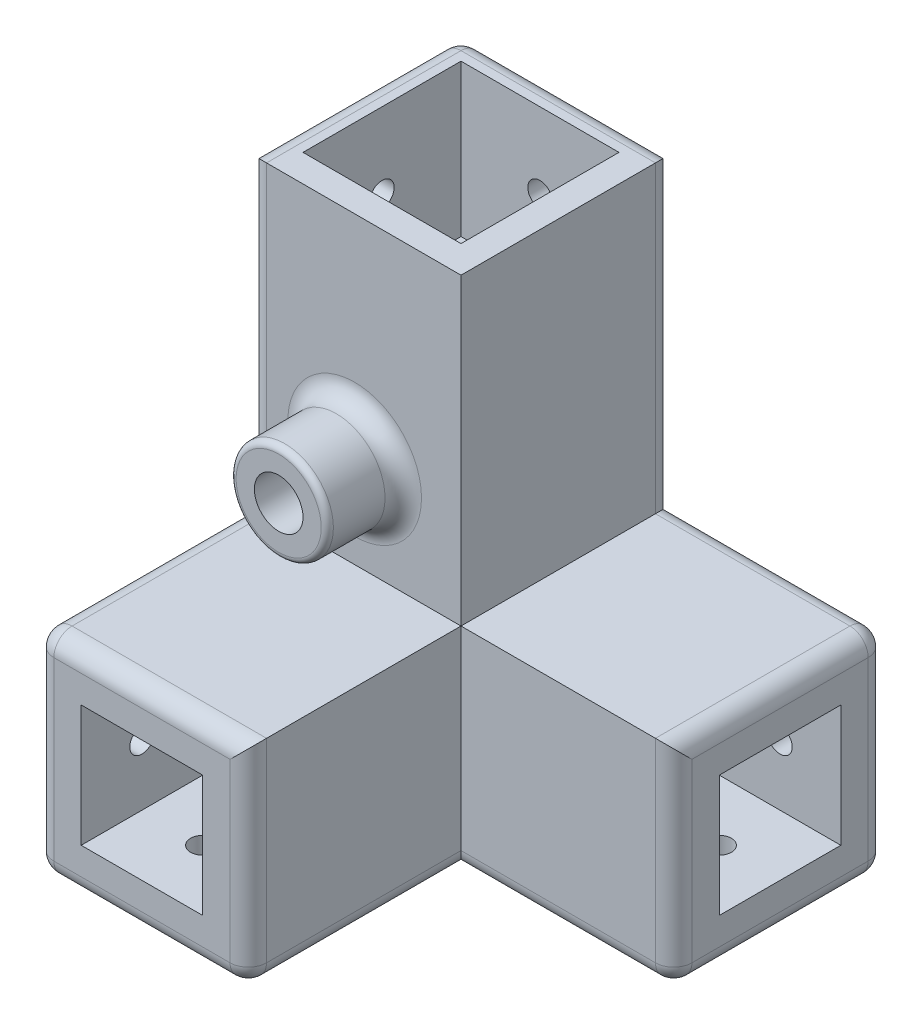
ISO-10303-21;
HEADER;
FILE_DESCRIPTION(('STEP AP214'),'2;1');
FILE_NAME('part.step','',(''),(''),'','','');
FILE_SCHEMA(('AUTOMOTIVE_DESIGN { 1 0 10303 214 1 1 1 1 }'));
ENDSEC;
DATA;
#1=APPLICATION_CONTEXT('core data for automotive mechanical design processes');
#2=APPLICATION_PROTOCOL_DEFINITION('international standard','automotive_design',2000,#1);
#3=PRODUCT_CONTEXT('',#1,'mechanical');
#4=PRODUCT('Part','Part','',(#3));
#5=PRODUCT_RELATED_PRODUCT_CATEGORY('part','',(#4));
#6=PRODUCT_DEFINITION_FORMATION('','',#4);
#7=PRODUCT_DEFINITION_CONTEXT('part definition',#1,'design');
#8=PRODUCT_DEFINITION('design','',#6,#7);
#9=PRODUCT_DEFINITION_SHAPE('','',#8);
#10=(LENGTH_UNIT() NAMED_UNIT(*) SI_UNIT(.MILLI.,.METRE.));
#11=(NAMED_UNIT(*) PLANE_ANGLE_UNIT() SI_UNIT($,.RADIAN.));
#12=(NAMED_UNIT(*) SI_UNIT($,.STERADIAN.) SOLID_ANGLE_UNIT());
#13=UNCERTAINTY_MEASURE_WITH_UNIT(LENGTH_MEASURE(1.E-05),#10,'distance_accuracy_value','');
#14=(GEOMETRIC_REPRESENTATION_CONTEXT(3) GLOBAL_UNCERTAINTY_ASSIGNED_CONTEXT((#13)) GLOBAL_UNIT_ASSIGNED_CONTEXT((#10,
#11,#12)) REPRESENTATION_CONTEXT('',''));
#15=CARTESIAN_POINT('',(0.,0.,0.));
#16=DIRECTION('',(0.,0.,1.));
#17=DIRECTION('',(1.,0.,0.));
#18=AXIS2_PLACEMENT_3D('',#15,#16,#17);
#19=CARTESIAN_POINT('',(0.,0.,35.));
#20=DIRECTION('',(0.,0.,1.));
#21=DIRECTION('',(1.,0.,0.));
#22=AXIS2_PLACEMENT_3D('',#19,#20,#21);
#23=PLANE('',#22);
#24=CARTESIAN_POINT('',(17.5,50.,35.));
#25=DIRECTION('',(0.,0.,1.));
#26=DIRECTION('',(1.,0.,0.));
#27=AXIS2_PLACEMENT_3D('',#24,#25,#26);
#28=CIRCLE('',#27,11.);
#29=CARTESIAN_POINT('',(28.5,50.,35.));
#30=VERTEX_POINT('',#29);
#31=EDGE_CURVE('E701',#30,#30,#28,.F.);
#32=ORIENTED_EDGE('',*,*,#31,.T.);
#33=EDGE_LOOP('',(#32));
#34=FACE_BOUND('',#33,.T.);
#35=DIRECTION('',(-1.,0.,0.));
#36=VECTOR('',#35,1.);
#37=CARTESIAN_POINT('',(35.,85.,35.));
#38=LINE('',#37,#36);
#39=CARTESIAN_POINT('',(35.,85.,35.));
#40=VERTEX_POINT('',#39);
#41=CARTESIAN_POINT('',(3.,85.,35.));
#42=VERTEX_POINT('',#41);
#43=EDGE_CURVE('E414',#40,#42,#38,.T.);
#44=ORIENTED_EDGE('',*,*,#43,.T.);
#45=DIRECTION('',(0.,-1.,0.));
#46=VECTOR('',#45,1.);
#47=CARTESIAN_POINT('',(3.,35.,35.));
#48=LINE('',#47,#46);
#49=CARTESIAN_POINT('',(3.,35.,35.));
#50=VERTEX_POINT('',#49);
#51=EDGE_CURVE('E574',#42,#50,#48,.T.);
#52=ORIENTED_EDGE('',*,*,#51,.T.);
#53=DIRECTION('',(-1.,0.,0.));
#54=VECTOR('',#53,1.);
#55=CARTESIAN_POINT('',(0.,35.,35.));
#56=LINE('',#55,#54);
#57=CARTESIAN_POINT('',(35.,35.,35.));
#58=VERTEX_POINT('',#57);
#59=EDGE_CURVE('E406',#58,#50,#56,.T.);
#60=ORIENTED_EDGE('',*,*,#59,.F.);
#61=DIRECTION('',(0.,1.,0.));
#62=VECTOR('',#61,1.);
#63=CARTESIAN_POINT('',(35.,35.,35.));
#64=LINE('',#63,#62);
#65=EDGE_CURVE('E421',#58,#40,#64,.T.);
#66=ORIENTED_EDGE('',*,*,#65,.T.);
#67=EDGE_LOOP('',(#44,#52,#60,#66));
#68=FACE_BOUND('',#67,.T.);
#69=ADVANCED_FACE('F43',(#34,#68),#23,.T.);
#70=CARTESIAN_POINT('',(35.,85.,35.));
#71=DIRECTION('',(0.,-1.,0.));
#72=DIRECTION('',(0.,0.,-1.));
#73=AXIS2_PLACEMENT_3D('',#70,#71,#72);
#74=PLANE('',#73);
#75=DIRECTION('',(-1.,0.,0.));
#76=VECTOR('',#75,1.);
#77=CARTESIAN_POINT('',(4.50000000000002,85.,4.5));
#78=LINE('',#77,#76);
#79=CARTESIAN_POINT('',(30.5,85.,4.5));
#80=VERTEX_POINT('',#79);
#81=CARTESIAN_POINT('',(4.50000000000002,85.,4.5));
#82=VERTEX_POINT('',#81);
#83=EDGE_CURVE('E299',#80,#82,#78,.T.);
#84=ORIENTED_EDGE('',*,*,#83,.F.);
#85=DIRECTION('',(0.,0.,-1.));
#86=VECTOR('',#85,1.);
#87=CARTESIAN_POINT('',(30.5,85.,4.5));
#88=LINE('',#87,#86);
#89=CARTESIAN_POINT('',(30.5,85.,30.5));
#90=VERTEX_POINT('',#89);
#91=EDGE_CURVE('E263',#90,#80,#88,.T.);
#92=ORIENTED_EDGE('',*,*,#91,.F.);
#93=DIRECTION('',(1.,0.,0.));
#94=VECTOR('',#93,1.);
#95=CARTESIAN_POINT('',(4.50000000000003,85.,30.5));
#96=LINE('',#95,#94);
#97=CARTESIAN_POINT('',(4.50000000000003,85.,30.5));
#98=VERTEX_POINT('',#97);
#99=EDGE_CURVE('E283',#98,#90,#96,.T.);
#100=ORIENTED_EDGE('',*,*,#99,.F.);
#101=DIRECTION('',(0.,0.,1.));
#102=VECTOR('',#101,1.);
#103=CARTESIAN_POINT('',(4.50000000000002,85.,4.5));
#104=LINE('',#103,#102);
#105=EDGE_CURVE('E287',#82,#98,#104,.T.);
#106=ORIENTED_EDGE('',*,*,#105,.F.);
#107=EDGE_LOOP('',(#84,#92,#100,#106));
#108=FACE_BOUND('',#107,.T.);
#109=DIRECTION('',(0.,0.,-1.));
#110=VECTOR('',#109,1.);
#111=CARTESIAN_POINT('',(35.,85.,35.));
#112=LINE('',#111,#110);
#113=CARTESIAN_POINT('',(35.,85.,3.));
#114=VERTEX_POINT('',#113);
#115=EDGE_CURVE('E424',#40,#114,#112,.T.);
#116=ORIENTED_EDGE('',*,*,#115,.T.);
#117=DIRECTION('',(-1.,0.,0.));
#118=VECTOR('',#117,1.);
#119=CARTESIAN_POINT('',(35.,85.,3.));
#120=LINE('',#119,#118);
#121=CARTESIAN_POINT('',(3.,85.,3.));
#122=VERTEX_POINT('',#121);
#123=EDGE_CURVE('E462',#114,#122,#120,.T.);
#124=ORIENTED_EDGE('',*,*,#123,.T.);
#125=DIRECTION('',(0.,0.,-1.));
#126=VECTOR('',#125,1.);
#127=CARTESIAN_POINT('',(3.,85.,35.));
#128=LINE('',#127,#126);
#129=EDGE_CURVE('E432',#122,#42,#128,.F.);
#130=ORIENTED_EDGE('',*,*,#129,.T.);
#131=ORIENTED_EDGE('',*,*,#43,.F.);
#132=EDGE_LOOP('',(#116,#124,#130,#131));
#133=FACE_BOUND('',#132,.T.);
#134=ADVANCED_FACE('F721',(#108,#133),#74,.F.);
#135=CARTESIAN_POINT('',(0.,85.,35.));
#136=DIRECTION('',(1.,0.,0.));
#137=DIRECTION('',(0.,1.,0.));
#138=AXIS2_PLACEMENT_3D('',#135,#136,#137);
#139=PLANE('',#138);
#140=DIRECTION('',(0.,-1.,0.));
#141=VECTOR('',#140,1.);
#142=CARTESIAN_POINT('',(0.,85.,32.));
#143=LINE('',#142,#141);
#144=CARTESIAN_POINT('',(0.,32.,32.));
#145=VERTEX_POINT('',#144);
#146=CARTESIAN_POINT('',(0.,82.,32.));
#147=VERTEX_POINT('',#146);
#148=EDGE_CURVE('E67',#145,#147,#143,.F.);
#149=ORIENTED_EDGE('',*,*,#148,.T.);
#150=DIRECTION('',(0.,0.,-1.));
#151=VECTOR('',#150,1.);
#152=CARTESIAN_POINT('',(0.,82.,35.));
#153=LINE('',#152,#151);
#154=CARTESIAN_POINT('',(0.,82.,3.));
#155=VERTEX_POINT('',#154);
#156=EDGE_CURVE('E571',#147,#155,#153,.T.);
#157=ORIENTED_EDGE('',*,*,#156,.T.);
#158=DIRECTION('',(0.,-1.,0.));
#159=VECTOR('',#158,1.);
#160=CARTESIAN_POINT('',(0.,85.,3.));
#161=LINE('',#160,#159);
#162=CARTESIAN_POINT('',(0.,3.,3.));
#163=VERTEX_POINT('',#162);
#164=EDGE_CURVE('E568',#155,#163,#161,.T.);
#165=ORIENTED_EDGE('',*,*,#164,.T.);
#166=DIRECTION('',(0.,0.,-1.));
#167=VECTOR('',#166,1.);
#168=CARTESIAN_POINT('',(0.,3.,35.));
#169=LINE('',#168,#167);
#170=CARTESIAN_POINT('',(0.,3.,67.));
#171=VERTEX_POINT('',#170);
#172=EDGE_CURVE('E557',#163,#171,#169,.F.);
#173=ORIENTED_EDGE('',*,*,#172,.T.);
#174=DIRECTION('',(0.,-1.,0.));
#175=VECTOR('',#174,1.);
#176=CARTESIAN_POINT('',(0.,85.,67.));
#177=LINE('',#176,#175);
#178=CARTESIAN_POINT('',(0.,32.,67.));
#179=VERTEX_POINT('',#178);
#180=EDGE_CURVE('E560',#171,#179,#177,.F.);
#181=ORIENTED_EDGE('',*,*,#180,.T.);
#182=DIRECTION('',(0.,0.,-1.));
#183=VECTOR('',#182,1.);
#184=CARTESIAN_POINT('',(0.,32.,35.));
#185=LINE('',#184,#183);
#186=EDGE_CURVE('E563',#179,#145,#185,.T.);
#187=ORIENTED_EDGE('',*,*,#186,.T.);
#188=EDGE_LOOP('',(#149,#157,#165,#173,#181,#187));
#189=FACE_BOUND('',#188,.T.);
#190=CARTESIAN_POINT('',(0.,72.5,17.5));
#191=DIRECTION('',(-1.,0.,0.));
#192=DIRECTION('',(0.,-1.,0.));
#193=AXIS2_PLACEMENT_3D('',#190,#191,#192);
#194=CIRCLE('',#193,2.);
#195=CARTESIAN_POINT('',(0.,70.5,17.5));
#196=VERTEX_POINT('',#195);
#197=EDGE_CURVE('E437',#196,#196,#194,.T.);
#198=ORIENTED_EDGE('',*,*,#197,.F.);
#199=EDGE_LOOP('',(#198));
#200=FACE_BOUND('',#199,.T.);
#201=CARTESIAN_POINT('',(0.,17.5,60.));
#202=DIRECTION('',(-1.,0.,0.));
#203=DIRECTION('',(0.,-1.,0.));
#204=AXIS2_PLACEMENT_3D('',#201,#202,#203);
#205=CIRCLE('',#204,2.);
#206=CARTESIAN_POINT('',(0.,15.5,60.));
#207=VERTEX_POINT('',#206);
#208=EDGE_CURVE('E290',#207,#207,#205,.T.);
#209=ORIENTED_EDGE('',*,*,#208,.F.);
#210=EDGE_LOOP('',(#209));
#211=FACE_BOUND('',#210,.T.);
#212=ADVANCED_FACE('F728',(#189,#200,#211),#139,.F.);
#213=CARTESIAN_POINT('',(0.,0.,35.));
#214=DIRECTION('',(0.,1.,0.));
#215=DIRECTION('',(0.,0.,1.));
#216=AXIS2_PLACEMENT_3D('',#213,#214,#215);
#217=PLANE('',#216);
#218=DIRECTION('',(0.,0.,-1.));
#219=VECTOR('',#218,1.);
#220=CARTESIAN_POINT('',(32.,0.,35.));
#221=LINE('',#220,#219);
#222=CARTESIAN_POINT('',(32.,0.,32.));
#223=VERTEX_POINT('',#222);
#224=CARTESIAN_POINT('',(32.,0.,67.));
#225=VERTEX_POINT('',#224);
#226=EDGE_CURVE('E510',#223,#225,#221,.F.);
#227=ORIENTED_EDGE('',*,*,#226,.T.);
#228=DIRECTION('',(1.,0.,0.));
#229=VECTOR('',#228,1.);
#230=CARTESIAN_POINT('',(0.,0.,67.));
#231=LINE('',#230,#229);
#232=CARTESIAN_POINT('',(3.,0.,67.));
#233=VERTEX_POINT('',#232);
#234=EDGE_CURVE('E513',#225,#233,#231,.F.);
#235=ORIENTED_EDGE('',*,*,#234,.T.);
#236=DIRECTION('',(0.,0.,-1.));
#237=VECTOR('',#236,1.);
#238=CARTESIAN_POINT('',(3.,0.,35.));
#239=LINE('',#238,#237);
#240=CARTESIAN_POINT('',(3.,0.,3.));
#241=VERTEX_POINT('',#240);
#242=EDGE_CURVE('E498',#233,#241,#239,.T.);
#243=ORIENTED_EDGE('',*,*,#242,.T.);
#244=DIRECTION('',(1.,0.,0.));
#245=VECTOR('',#244,1.);
#246=CARTESIAN_POINT('',(0.,0.,3.));
#247=LINE('',#246,#245);
#248=CARTESIAN_POINT('',(67.,0.,3.));
#249=VERTEX_POINT('',#248);
#250=EDGE_CURVE('E501',#241,#249,#247,.T.);
#251=ORIENTED_EDGE('',*,*,#250,.T.);
#252=DIRECTION('',(0.,0.,-1.));
#253=VECTOR('',#252,1.);
#254=CARTESIAN_POINT('',(67.,0.,35.));
#255=LINE('',#254,#253);
#256=CARTESIAN_POINT('',(67.,0.,32.));
#257=VERTEX_POINT('',#256);
#258=EDGE_CURVE('E504',#249,#257,#255,.F.);
#259=ORIENTED_EDGE('',*,*,#258,.T.);
#260=DIRECTION('',(1.,0.,0.));
#261=VECTOR('',#260,1.);
#262=CARTESIAN_POINT('',(35.,0.,32.));
#263=LINE('',#262,#261);
#264=EDGE_CURVE('E507',#257,#223,#263,.F.);
#265=ORIENTED_EDGE('',*,*,#264,.T.);
#266=EDGE_LOOP('',(#227,#235,#243,#251,#259,#265));
#267=FACE_BOUND('',#266,.T.);
#268=CARTESIAN_POINT('',(17.5,0.,60.));
#269=DIRECTION('',(0.,-1.,0.));
#270=DIRECTION('',(0.,0.,-1.));
#271=AXIS2_PLACEMENT_3D('',#268,#269,#270);
#272=CIRCLE('',#271,2.);
#273=CARTESIAN_POINT('',(17.5,0.,58.));
#274=VERTEX_POINT('',#273);
#275=EDGE_CURVE('E455',#274,#274,#272,.T.);
#276=ORIENTED_EDGE('',*,*,#275,.F.);
#277=EDGE_LOOP('',(#276));
#278=FACE_BOUND('',#277,.T.);
#279=CARTESIAN_POINT('',(60.,0.,17.5));
#280=DIRECTION('',(0.,-1.,0.));
#281=DIRECTION('',(0.,0.,-1.));
#282=AXIS2_PLACEMENT_3D('',#279,#280,#281);
#283=CIRCLE('',#282,2.);
#284=CARTESIAN_POINT('',(60.,0.,15.5));
#285=VERTEX_POINT('',#284);
#286=EDGE_CURVE('E697',#285,#285,#283,.T.);
#287=ORIENTED_EDGE('',*,*,#286,.F.);
#288=EDGE_LOOP('',(#287));
#289=FACE_BOUND('',#288,.T.);
#290=ADVANCED_FACE('F822',(#267,#278,#289),#217,.F.);
#291=CARTESIAN_POINT('',(70.,0.,35.));
#292=DIRECTION('',(-1.,0.,0.));
#293=DIRECTION('',(0.,0.,1.));
#294=AXIS2_PLACEMENT_3D('',#291,#292,#293);
#295=PLANE('',#294);
#296=DIRECTION('',(0.,0.,-1.));
#297=VECTOR('',#296,1.);
#298=CARTESIAN_POINT('',(70.,32.,35.));
#299=LINE('',#298,#297);
#300=CARTESIAN_POINT('',(70.,32.,3.));
#301=VERTEX_POINT('',#300);
#302=CARTESIAN_POINT('',(70.,32.,32.));
#303=VERTEX_POINT('',#302);
#304=EDGE_CURVE('E541',#301,#303,#299,.F.);
#305=ORIENTED_EDGE('',*,*,#304,.T.);
#306=DIRECTION('',(0.,1.,0.));
#307=VECTOR('',#306,1.);
#308=CARTESIAN_POINT('',(70.,0.,32.));
#309=LINE('',#308,#307);
#310=CARTESIAN_POINT('',(70.,3.,32.));
#311=VERTEX_POINT('',#310);
#312=EDGE_CURVE('E544',#303,#311,#309,.F.);
#313=ORIENTED_EDGE('',*,*,#312,.T.);
#314=DIRECTION('',(0.,0.,-1.));
#315=VECTOR('',#314,1.);
#316=CARTESIAN_POINT('',(70.,3.,35.));
#317=LINE('',#316,#315);
#318=CARTESIAN_POINT('',(70.,3.,3.));
#319=VERTEX_POINT('',#318);
#320=EDGE_CURVE('E538',#311,#319,#317,.T.);
#321=ORIENTED_EDGE('',*,*,#320,.T.);
#322=DIRECTION('',(0.,1.,0.));
#323=VECTOR('',#322,1.);
#324=CARTESIAN_POINT('',(70.,0.,3.));
#325=LINE('',#324,#323);
#326=EDGE_CURVE('E535',#319,#301,#325,.T.);
#327=ORIENTED_EDGE('',*,*,#326,.T.);
#328=EDGE_LOOP('',(#305,#313,#321,#327));
#329=FACE_BOUND('',#328,.T.);
#330=DIRECTION('',(0.,0.,1.));
#331=VECTOR('',#330,1.);
#332=CARTESIAN_POINT('',(70.,27.5,27.5));
#333=LINE('',#332,#331);
#334=CARTESIAN_POINT('',(70.,27.5,7.50000000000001));
#335=VERTEX_POINT('',#334);
#336=CARTESIAN_POINT('',(70.,27.5,27.5));
#337=VERTEX_POINT('',#336);
#338=EDGE_CURVE('E335',#335,#337,#333,.T.);
#339=ORIENTED_EDGE('',*,*,#338,.F.);
#340=DIRECTION('',(0.,1.,0.));
#341=VECTOR('',#340,1.);
#342=CARTESIAN_POINT('',(70.,27.5,7.50000000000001));
#343=LINE('',#342,#341);
#344=CARTESIAN_POINT('',(70.,7.5,7.5));
#345=VERTEX_POINT('',#344);
#346=EDGE_CURVE('E309',#345,#335,#343,.T.);
#347=ORIENTED_EDGE('',*,*,#346,.F.);
#348=DIRECTION('',(0.,0.,-1.));
#349=VECTOR('',#348,1.);
#350=CARTESIAN_POINT('',(70.,7.5,27.5));
#351=LINE('',#350,#349);
#352=CARTESIAN_POINT('',(70.,7.5,27.5));
#353=VERTEX_POINT('',#352);
#354=EDGE_CURVE('E320',#353,#345,#351,.T.);
#355=ORIENTED_EDGE('',*,*,#354,.F.);
#356=DIRECTION('',(0.,-1.,0.));
#357=VECTOR('',#356,1.);
#358=CARTESIAN_POINT('',(70.,27.5,27.5));
#359=LINE('',#358,#357);
#360=EDGE_CURVE('E339',#337,#353,#359,.T.);
#361=ORIENTED_EDGE('',*,*,#360,.F.);
#362=EDGE_LOOP('',(#339,#347,#355,#361));
#363=FACE_BOUND('',#362,.T.);
#364=ADVANCED_FACE('F836',(#329,#363),#295,.F.);
#365=CARTESIAN_POINT('',(70.,35.,35.));
#366=DIRECTION('',(0.,-1.,0.));
#367=DIRECTION('',(0.,0.,-1.));
#368=AXIS2_PLACEMENT_3D('',#365,#366,#367);
#369=PLANE('',#368);
#370=DIRECTION('',(-1.,0.,0.));
#371=VECTOR('',#370,1.);
#372=CARTESIAN_POINT('',(70.,35.,35.));
#373=LINE('',#372,#371);
#374=CARTESIAN_POINT('',(67.,35.,35.));
#375=VERTEX_POINT('',#374);
#376=EDGE_CURVE('E418',#375,#58,#373,.T.);
#377=ORIENTED_EDGE('',*,*,#376,.F.);
#378=DIRECTION('',(0.,0.,-1.));
#379=VECTOR('',#378,1.);
#380=CARTESIAN_POINT('',(67.,35.,35.));
#381=LINE('',#380,#379);
#382=CARTESIAN_POINT('',(67.,35.,3.));
#383=VERTEX_POINT('',#382);
#384=EDGE_CURVE('E551',#375,#383,#381,.T.);
#385=ORIENTED_EDGE('',*,*,#384,.T.);
#386=DIRECTION('',(-1.,0.,0.));
#387=VECTOR('',#386,1.);
#388=CARTESIAN_POINT('',(70.,35.,3.));
#389=LINE('',#388,#387);
#390=CARTESIAN_POINT('',(35.,35.,3.));
#391=VERTEX_POINT('',#390);
#392=EDGE_CURVE('E548',#383,#391,#389,.T.);
#393=ORIENTED_EDGE('',*,*,#392,.T.);
#394=DIRECTION('',(0.,0.,-1.));
#395=VECTOR('',#394,1.);
#396=CARTESIAN_POINT('',(35.,35.,35.));
#397=LINE('',#396,#395);
#398=EDGE_CURVE('E428',#58,#391,#397,.T.);
#399=ORIENTED_EDGE('',*,*,#398,.F.);
#400=EDGE_LOOP('',(#377,#385,#393,#399));
#401=FACE_BOUND('',#400,.T.);
#402=ADVANCED_FACE('F744',(#401),#369,.F.);
#403=CARTESIAN_POINT('',(35.,35.,35.));
#404=DIRECTION('',(-1.,0.,0.));
#405=DIRECTION('',(0.,0.,1.));
#406=AXIS2_PLACEMENT_3D('',#403,#404,#405);
#407=PLANE('',#406);
#408=ORIENTED_EDGE('',*,*,#398,.T.);
#409=DIRECTION('',(0.,1.,0.));
#410=VECTOR('',#409,1.);
#411=CARTESIAN_POINT('',(35.,35.,3.));
#412=LINE('',#411,#410);
#413=EDGE_CURVE('E554',#391,#114,#412,.T.);
#414=ORIENTED_EDGE('',*,*,#413,.T.);
#415=ORIENTED_EDGE('',*,*,#115,.F.);
#416=ORIENTED_EDGE('',*,*,#65,.F.);
#417=EDGE_LOOP('',(#408,#414,#415,#416));
#418=FACE_BOUND('',#417,.T.);
#419=ADVANCED_FACE('F736',(#418),#407,.F.);
#420=DIRECTION('',(0.,1.,0.));
#421=VECTOR('',#420,1.);
#422=CARTESIAN_POINT('',(35.,0.,35.));
#423=LINE('',#422,#421);
#424=CARTESIAN_POINT('',(35.,3.,35.));
#425=VERTEX_POINT('',#424);
#426=EDGE_CURVE('E393',#425,#58,#423,.T.);
#427=ORIENTED_EDGE('',*,*,#426,.F.);
#428=DIRECTION('',(1.,0.,0.));
#429=VECTOR('',#428,1.);
#430=CARTESIAN_POINT('',(70.,3.,35.));
#431=LINE('',#430,#429);
#432=CARTESIAN_POINT('',(67.,3.,35.));
#433=VERTEX_POINT('',#432);
#434=EDGE_CURVE('E532',#425,#433,#431,.T.);
#435=ORIENTED_EDGE('',*,*,#434,.T.);
#436=DIRECTION('',(0.,1.,0.));
#437=VECTOR('',#436,1.);
#438=CARTESIAN_POINT('',(67.,35.,35.));
#439=LINE('',#438,#437);
#440=EDGE_CURVE('E529',#433,#375,#439,.T.);
#441=ORIENTED_EDGE('',*,*,#440,.T.);
#442=ORIENTED_EDGE('',*,*,#376,.T.);
#443=EDGE_LOOP('',(#427,#435,#441,#442));
#444=FACE_BOUND('',#443,.T.);
#445=ADVANCED_FACE('F724',(#444),#23,.T.);
#446=CARTESIAN_POINT('',(0.,0.,0.));
#447=DIRECTION('',(0.,0.,1.));
#448=DIRECTION('',(1.,0.,0.));
#449=AXIS2_PLACEMENT_3D('',#446,#447,#448);
#450=PLANE('',#449);
#451=DIRECTION('',(-1.,0.,0.));
#452=VECTOR('',#451,1.);
#453=CARTESIAN_POINT('',(0.,32.,0.));
#454=LINE('',#453,#452);
#455=CARTESIAN_POINT('',(32.,32.,0.));
#456=VERTEX_POINT('',#455);
#457=CARTESIAN_POINT('',(67.,32.,0.));
#458=VERTEX_POINT('',#457);
#459=EDGE_CURVE('E479',#456,#458,#454,.F.);
#460=ORIENTED_EDGE('',*,*,#459,.T.);
#461=DIRECTION('',(0.,1.,0.));
#462=VECTOR('',#461,1.);
#463=CARTESIAN_POINT('',(67.,0.,0.));
#464=LINE('',#463,#462);
#465=CARTESIAN_POINT('',(67.,3.,0.));
#466=VERTEX_POINT('',#465);
#467=EDGE_CURVE('E482',#458,#466,#464,.F.);
#468=ORIENTED_EDGE('',*,*,#467,.T.);
#469=DIRECTION('',(1.,0.,0.));
#470=VECTOR('',#469,1.);
#471=CARTESIAN_POINT('',(0.,3.,0.));
#472=LINE('',#471,#470);
#473=CARTESIAN_POINT('',(3.,3.,0.));
#474=VERTEX_POINT('',#473);
#475=EDGE_CURVE('E469',#466,#474,#472,.F.);
#476=ORIENTED_EDGE('',*,*,#475,.T.);
#477=DIRECTION('',(0.,-1.,0.));
#478=VECTOR('',#477,1.);
#479=CARTESIAN_POINT('',(3.,0.,0.));
#480=LINE('',#479,#478);
#481=CARTESIAN_POINT('',(3.,82.,0.));
#482=VERTEX_POINT('',#481);
#483=EDGE_CURVE('E466',#474,#482,#480,.F.);
#484=ORIENTED_EDGE('',*,*,#483,.T.);
#485=DIRECTION('',(-1.,0.,0.));
#486=VECTOR('',#485,1.);
#487=CARTESIAN_POINT('',(0.,82.,0.));
#488=LINE('',#487,#486);
#489=CARTESIAN_POINT('',(32.,82.,0.));
#490=VERTEX_POINT('',#489);
#491=EDGE_CURVE('E472',#482,#490,#488,.F.);
#492=ORIENTED_EDGE('',*,*,#491,.T.);
#493=DIRECTION('',(0.,1.,0.));
#494=VECTOR('',#493,1.);
#495=CARTESIAN_POINT('',(32.,0.,0.));
#496=LINE('',#495,#494);
#497=EDGE_CURVE('E476',#490,#456,#496,.F.);
#498=ORIENTED_EDGE('',*,*,#497,.T.);
#499=EDGE_LOOP('',(#460,#468,#476,#484,#492,#498));
#500=FACE_BOUND('',#499,.T.);
#501=CARTESIAN_POINT('',(17.5,72.5,0.));
#502=DIRECTION('',(0.,0.,-1.));
#503=DIRECTION('',(-1.,0.,0.));
#504=AXIS2_PLACEMENT_3D('',#501,#502,#503);
#505=CIRCLE('',#504,2.);
#506=CARTESIAN_POINT('',(15.5,72.5,0.));
#507=VERTEX_POINT('',#506);
#508=EDGE_CURVE('E446',#507,#507,#505,.T.);
#509=ORIENTED_EDGE('',*,*,#508,.F.);
#510=EDGE_LOOP('',(#509));
#511=FACE_BOUND('',#510,.T.);
#512=CARTESIAN_POINT('',(60.,17.5,0.));
#513=DIRECTION('',(0.,0.,-1.));
#514=DIRECTION('',(-1.,0.,0.));
#515=AXIS2_PLACEMENT_3D('',#512,#513,#514);
#516=CIRCLE('',#515,2.);
#517=CARTESIAN_POINT('',(58.,17.5,0.));
#518=VERTEX_POINT('',#517);
#519=EDGE_CURVE('E459',#518,#518,#516,.T.);
#520=ORIENTED_EDGE('',*,*,#519,.F.);
#521=EDGE_LOOP('',(#520));
#522=FACE_BOUND('',#521,.T.);
#523=ADVANCED_FACE('F735',(#500,#511,#522),#450,.F.);
#524=CARTESIAN_POINT('',(35.,0.,70.));
#525=DIRECTION('',(-1.,0.,0.));
#526=DIRECTION('',(0.,0.,1.));
#527=AXIS2_PLACEMENT_3D('',#524,#525,#526);
#528=PLANE('',#527);
#529=DIRECTION('',(0.,0.,-1.));
#530=VECTOR('',#529,1.);
#531=CARTESIAN_POINT('',(35.,35.,70.));
#532=LINE('',#531,#530);
#533=CARTESIAN_POINT('',(35.,35.,67.));
#534=VERTEX_POINT('',#533);
#535=EDGE_CURVE('E410',#534,#58,#532,.T.);
#536=ORIENTED_EDGE('',*,*,#535,.F.);
#537=DIRECTION('',(0.,1.,0.));
#538=VECTOR('',#537,1.);
#539=CARTESIAN_POINT('',(35.,0.,67.));
#540=LINE('',#539,#538);
#541=CARTESIAN_POINT('',(35.,3.,67.));
#542=VERTEX_POINT('',#541);
#543=EDGE_CURVE('E526',#534,#542,#540,.F.);
#544=ORIENTED_EDGE('',*,*,#543,.T.);
#545=DIRECTION('',(0.,0.,-1.));
#546=VECTOR('',#545,1.);
#547=CARTESIAN_POINT('',(35.,3.,70.));
#548=LINE('',#547,#546);
#549=EDGE_CURVE('E523',#542,#425,#548,.T.);
#550=ORIENTED_EDGE('',*,*,#549,.T.);
#551=ORIENTED_EDGE('',*,*,#426,.T.);
#552=EDGE_LOOP('',(#536,#544,#550,#551));
#553=FACE_BOUND('',#552,.T.);
#554=ADVANCED_FACE('F742',(#553),#528,.F.);
#555=CARTESIAN_POINT('',(0.,35.,70.));
#556=DIRECTION('',(0.,-1.,0.));
#557=DIRECTION('',(0.,0.,-1.));
#558=AXIS2_PLACEMENT_3D('',#555,#556,#557);
#559=PLANE('',#558);
#560=DIRECTION('',(0.,0.,-1.));
#561=VECTOR('',#560,1.);
#562=CARTESIAN_POINT('',(3.,35.,70.));
#563=LINE('',#562,#561);
#564=CARTESIAN_POINT('',(3.,35.,67.));
#565=VERTEX_POINT('',#564);
#566=EDGE_CURVE('E517',#50,#565,#563,.F.);
#567=ORIENTED_EDGE('',*,*,#566,.T.);
#568=DIRECTION('',(-1.,0.,0.));
#569=VECTOR('',#568,1.);
#570=CARTESIAN_POINT('',(0.,35.,67.));
#571=LINE('',#570,#569);
#572=EDGE_CURVE('E520',#565,#534,#571,.F.);
#573=ORIENTED_EDGE('',*,*,#572,.T.);
#574=ORIENTED_EDGE('',*,*,#535,.T.);
#575=ORIENTED_EDGE('',*,*,#59,.T.);
#576=EDGE_LOOP('',(#567,#573,#574,#575));
#577=FACE_BOUND('',#576,.T.);
#578=ADVANCED_FACE('F784',(#577),#559,.F.);
#579=CARTESIAN_POINT('',(0.,0.,70.));
#580=DIRECTION('',(0.,0.,-1.));
#581=DIRECTION('',(-1.,0.,0.));
#582=AXIS2_PLACEMENT_3D('',#579,#580,#581);
#583=PLANE('',#582);
#584=DIRECTION('',(1.,0.,0.));
#585=VECTOR('',#584,1.);
#586=CARTESIAN_POINT('',(0.,3.,70.));
#587=LINE('',#586,#585);
#588=CARTESIAN_POINT('',(3.,3.,70.));
#589=VERTEX_POINT('',#588);
#590=CARTESIAN_POINT('',(32.,3.,70.));
#591=VERTEX_POINT('',#590);
#592=EDGE_CURVE('E491',#589,#591,#587,.T.);
#593=ORIENTED_EDGE('',*,*,#592,.T.);
#594=DIRECTION('',(0.,1.,0.));
#595=VECTOR('',#594,1.);
#596=CARTESIAN_POINT('',(32.,0.,70.));
#597=LINE('',#596,#595);
#598=CARTESIAN_POINT('',(32.,32.,70.));
#599=VERTEX_POINT('',#598);
#600=EDGE_CURVE('E495',#591,#599,#597,.T.);
#601=ORIENTED_EDGE('',*,*,#600,.T.);
#602=DIRECTION('',(-1.,0.,0.));
#603=VECTOR('',#602,1.);
#604=CARTESIAN_POINT('',(0.,32.,70.));
#605=LINE('',#604,#603);
#606=CARTESIAN_POINT('',(3.,32.,70.));
#607=VERTEX_POINT('',#606);
#608=EDGE_CURVE('E488',#599,#607,#605,.T.);
#609=ORIENTED_EDGE('',*,*,#608,.T.);
#610=DIRECTION('',(0.,-1.,0.));
#611=VECTOR('',#610,1.);
#612=CARTESIAN_POINT('',(3.,0.,70.));
#613=LINE('',#612,#611);
#614=EDGE_CURVE('E485',#607,#589,#613,.T.);
#615=ORIENTED_EDGE('',*,*,#614,.T.);
#616=EDGE_LOOP('',(#593,#601,#609,#615));
#617=FACE_BOUND('',#616,.T.);
#618=DIRECTION('',(-1.,0.,0.));
#619=VECTOR('',#618,1.);
#620=CARTESIAN_POINT('',(7.5,27.5,70.));
#621=LINE('',#620,#619);
#622=CARTESIAN_POINT('',(27.5,27.5,70.));
#623=VERTEX_POINT('',#622);
#624=CARTESIAN_POINT('',(7.5,27.5,70.));
#625=VERTEX_POINT('',#624);
#626=EDGE_CURVE('E379',#623,#625,#621,.T.);
#627=ORIENTED_EDGE('',*,*,#626,.F.);
#628=DIRECTION('',(0.,1.,0.));
#629=VECTOR('',#628,1.);
#630=CARTESIAN_POINT('',(27.5,27.5,70.));
#631=LINE('',#630,#629);
#632=CARTESIAN_POINT('',(27.5,7.50000000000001,70.));
#633=VERTEX_POINT('',#632);
#634=EDGE_CURVE('E349',#633,#623,#631,.T.);
#635=ORIENTED_EDGE('',*,*,#634,.F.);
#636=DIRECTION('',(1.,0.,0.));
#637=VECTOR('',#636,1.);
#638=CARTESIAN_POINT('',(7.5,7.5,70.));
#639=LINE('',#638,#637);
#640=CARTESIAN_POINT('',(7.5,7.5,70.));
#641=VERTEX_POINT('',#640);
#642=EDGE_CURVE('E364',#641,#633,#639,.T.);
#643=ORIENTED_EDGE('',*,*,#642,.F.);
#644=DIRECTION('',(0.,-1.,0.));
#645=VECTOR('',#644,1.);
#646=CARTESIAN_POINT('',(7.5,27.5,70.));
#647=LINE('',#646,#645);
#648=EDGE_CURVE('E383',#625,#641,#647,.T.);
#649=ORIENTED_EDGE('',*,*,#648,.F.);
#650=EDGE_LOOP('',(#627,#635,#643,#649));
#651=FACE_BOUND('',#650,.T.);
#652=ADVANCED_FACE('F1015',(#617,#651),#583,.F.);
#653=CARTESIAN_POINT('',(27.5,27.5,50.));
#654=DIRECTION('',(1.,0.,0.));
#655=DIRECTION('',(0.,1.,0.));
#656=AXIS2_PLACEMENT_3D('',#653,#654,#655);
#657=PLANE('',#656);
#658=ORIENTED_EDGE('',*,*,#634,.T.);
#659=DIRECTION('',(0.,0.,1.));
#660=VECTOR('',#659,1.);
#661=CARTESIAN_POINT('',(27.5,27.5,50.));
#662=LINE('',#661,#660);
#663=CARTESIAN_POINT('',(27.5,27.5,50.));
#664=VERTEX_POINT('',#663);
#665=EDGE_CURVE('E376',#664,#623,#662,.T.);
#666=ORIENTED_EDGE('',*,*,#665,.F.);
#667=DIRECTION('',(0.,1.,0.));
#668=VECTOR('',#667,1.);
#669=CARTESIAN_POINT('',(27.5,27.5,50.));
#670=LINE('',#669,#668);
#671=CARTESIAN_POINT('',(27.5,7.50000000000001,50.));
#672=VERTEX_POINT('',#671);
#673=EDGE_CURVE('E359',#672,#664,#670,.T.);
#674=ORIENTED_EDGE('',*,*,#673,.F.);
#675=DIRECTION('',(0.,0.,1.));
#676=VECTOR('',#675,1.);
#677=CARTESIAN_POINT('',(27.5,7.50000000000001,50.));
#678=LINE('',#677,#676);
#679=EDGE_CURVE('E390',#672,#633,#678,.T.);
#680=ORIENTED_EDGE('',*,*,#679,.T.);
#681=EDGE_LOOP('',(#658,#666,#674,#680));
#682=FACE_BOUND('',#681,.T.);
#683=ADVANCED_FACE('F1005',(#682),#657,.F.);
#684=CARTESIAN_POINT('',(7.5,7.5,50.));
#685=DIRECTION('',(0.,-1.,0.));
#686=DIRECTION('',(1.,0.,0.));
#687=AXIS2_PLACEMENT_3D('',#684,#685,#686);
#688=PLANE('',#687);
#689=CARTESIAN_POINT('',(17.5,7.50000000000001,60.));
#690=DIRECTION('',(0.,-1.,0.));
#691=DIRECTION('',(1.,0.,0.));
#692=AXIS2_PLACEMENT_3D('',#689,#690,#691);
#693=CIRCLE('',#692,2.);
#694=CARTESIAN_POINT('',(19.5,7.50000000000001,60.));
#695=VERTEX_POINT('',#694);
#696=EDGE_CURVE('E454',#695,#695,#693,.T.);
#697=ORIENTED_EDGE('',*,*,#696,.T.);
#698=EDGE_LOOP('',(#697));
#699=FACE_BOUND('',#698,.T.);
#700=ORIENTED_EDGE('',*,*,#642,.T.);
#701=ORIENTED_EDGE('',*,*,#679,.F.);
#702=DIRECTION('',(1.,0.,0.));
#703=VECTOR('',#702,1.);
#704=CARTESIAN_POINT('',(7.5,7.5,50.));
#705=LINE('',#704,#703);
#706=CARTESIAN_POINT('',(7.5,7.5,50.));
#707=VERTEX_POINT('',#706);
#708=EDGE_CURVE('E372',#707,#672,#705,.T.);
#709=ORIENTED_EDGE('',*,*,#708,.F.);
#710=DIRECTION('',(0.,0.,1.));
#711=VECTOR('',#710,1.);
#712=CARTESIAN_POINT('',(7.5,7.5,50.));
#713=LINE('',#712,#711);
#714=EDGE_CURVE('E394',#707,#641,#713,.T.);
#715=ORIENTED_EDGE('',*,*,#714,.T.);
#716=EDGE_LOOP('',(#700,#701,#709,#715));
#717=FACE_BOUND('',#716,.T.);
#718=ADVANCED_FACE('F1001',(#699,#717),#688,.F.);
#719=CARTESIAN_POINT('',(7.5,27.5,50.));
#720=DIRECTION('',(-1.,0.,0.));
#721=DIRECTION('',(0.,-1.,0.));
#722=AXIS2_PLACEMENT_3D('',#719,#720,#721);
#723=PLANE('',#722);
#724=CARTESIAN_POINT('',(7.5,17.5,60.));
#725=DIRECTION('',(-1.,0.,0.));
#726=DIRECTION('',(0.,-1.,0.));
#727=AXIS2_PLACEMENT_3D('',#724,#725,#726);
#728=CIRCLE('',#727,2.);
#729=CARTESIAN_POINT('',(7.5,15.5,60.));
#730=VERTEX_POINT('',#729);
#731=EDGE_CURVE('E300',#730,#730,#728,.T.);
#732=ORIENTED_EDGE('',*,*,#731,.T.);
#733=EDGE_LOOP('',(#732));
#734=FACE_BOUND('',#733,.T.);
#735=ORIENTED_EDGE('',*,*,#648,.T.);
#736=ORIENTED_EDGE('',*,*,#714,.F.);
#737=DIRECTION('',(0.,-1.,0.));
#738=VECTOR('',#737,1.);
#739=CARTESIAN_POINT('',(7.5,27.5,50.));
#740=LINE('',#739,#738);
#741=CARTESIAN_POINT('',(7.5,27.5,50.));
#742=VERTEX_POINT('',#741);
#743=EDGE_CURVE('E368',#742,#707,#740,.T.);
#744=ORIENTED_EDGE('',*,*,#743,.F.);
#745=DIRECTION('',(0.,0.,1.));
#746=VECTOR('',#745,1.);
#747=CARTESIAN_POINT('',(7.5,27.5,50.));
#748=LINE('',#747,#746);
#749=EDGE_CURVE('E397',#742,#625,#748,.T.);
#750=ORIENTED_EDGE('',*,*,#749,.T.);
#751=EDGE_LOOP('',(#735,#736,#744,#750));
#752=FACE_BOUND('',#751,.T.);
#753=ADVANCED_FACE('F1004',(#734,#752),#723,.F.);
#754=CARTESIAN_POINT('',(7.5,27.5,50.));
#755=DIRECTION('',(0.,1.,0.));
#756=DIRECTION('',(-1.,0.,0.));
#757=AXIS2_PLACEMENT_3D('',#754,#755,#756);
#758=PLANE('',#757);
#759=ORIENTED_EDGE('',*,*,#626,.T.);
#760=ORIENTED_EDGE('',*,*,#749,.F.);
#761=DIRECTION('',(-1.,0.,0.));
#762=VECTOR('',#761,1.);
#763=CARTESIAN_POINT('',(7.5,27.5,50.));
#764=LINE('',#763,#762);
#765=EDGE_CURVE('E363',#664,#742,#764,.T.);
#766=ORIENTED_EDGE('',*,*,#765,.F.);
#767=ORIENTED_EDGE('',*,*,#665,.T.);
#768=EDGE_LOOP('',(#759,#760,#766,#767));
#769=FACE_BOUND('',#768,.T.);
#770=ADVANCED_FACE('F999',(#769),#758,.F.);
#771=CARTESIAN_POINT('',(0.,0.,50.));
#772=DIRECTION('',(0.,0.,1.));
#773=DIRECTION('',(1.,0.,0.));
#774=AXIS2_PLACEMENT_3D('',#771,#772,#773);
#775=PLANE('',#774);
#776=ORIENTED_EDGE('',*,*,#673,.T.);
#777=ORIENTED_EDGE('',*,*,#765,.T.);
#778=ORIENTED_EDGE('',*,*,#743,.T.);
#779=ORIENTED_EDGE('',*,*,#708,.T.);
#780=EDGE_LOOP('',(#776,#777,#778,#779));
#781=FACE_BOUND('',#780,.T.);
#782=ADVANCED_FACE('F995',(#781),#775,.T.);
#783=CARTESIAN_POINT('',(50.,27.5,7.50000000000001));
#784=DIRECTION('',(0.,0.,-1.));
#785=DIRECTION('',(0.,1.,0.));
#786=AXIS2_PLACEMENT_3D('',#783,#784,#785);
#787=PLANE('',#786);
#788=CARTESIAN_POINT('',(60.,17.5,7.5));
#789=DIRECTION('',(0.,0.,-1.));
#790=DIRECTION('',(0.,1.,0.));
#791=AXIS2_PLACEMENT_3D('',#788,#789,#790);
#792=CIRCLE('',#791,2.);
#793=CARTESIAN_POINT('',(60.,19.5,7.50000000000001));
#794=VERTEX_POINT('',#793);
#795=EDGE_CURVE('E445',#794,#794,#792,.T.);
#796=ORIENTED_EDGE('',*,*,#795,.T.);
#797=EDGE_LOOP('',(#796));
#798=FACE_BOUND('',#797,.T.);
#799=ORIENTED_EDGE('',*,*,#346,.T.);
#800=DIRECTION('',(1.,0.,0.));
#801=VECTOR('',#800,1.);
#802=CARTESIAN_POINT('',(50.,27.5,7.50000000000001));
#803=LINE('',#802,#801);
#804=CARTESIAN_POINT('',(50.,27.5,7.50000000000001));
#805=VERTEX_POINT('',#804);
#806=EDGE_CURVE('E332',#805,#335,#803,.T.);
#807=ORIENTED_EDGE('',*,*,#806,.F.);
#808=DIRECTION('',(0.,1.,0.));
#809=VECTOR('',#808,1.);
#810=CARTESIAN_POINT('',(50.,27.5,7.50000000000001));
#811=LINE('',#810,#809);
#812=CARTESIAN_POINT('',(50.,7.5,7.5));
#813=VERTEX_POINT('',#812);
#814=EDGE_CURVE('E315',#813,#805,#811,.T.);
#815=ORIENTED_EDGE('',*,*,#814,.F.);
#816=DIRECTION('',(1.,0.,0.));
#817=VECTOR('',#816,1.);
#818=CARTESIAN_POINT('',(50.,7.5,7.5));
#819=LINE('',#818,#817);
#820=EDGE_CURVE('E346',#813,#345,#819,.T.);
#821=ORIENTED_EDGE('',*,*,#820,.T.);
#822=EDGE_LOOP('',(#799,#807,#815,#821));
#823=FACE_BOUND('',#822,.T.);
#824=ADVANCED_FACE('F985',(#798,#823),#787,.F.);
#825=CARTESIAN_POINT('',(50.,7.5,27.5));
#826=DIRECTION('',(0.,-1.,0.));
#827=DIRECTION('',(0.,0.,-1.));
#828=AXIS2_PLACEMENT_3D('',#825,#826,#827);
#829=PLANE('',#828);
#830=CARTESIAN_POINT('',(60.,7.5,17.5));
#831=DIRECTION('',(0.,-1.,0.));
#832=DIRECTION('',(0.,0.,-1.));
#833=AXIS2_PLACEMENT_3D('',#830,#831,#832);
#834=CIRCLE('',#833,2.);
#835=CARTESIAN_POINT('',(60.,7.5,15.5));
#836=VERTEX_POINT('',#835);
#837=EDGE_CURVE('E450',#836,#836,#834,.T.);
#838=ORIENTED_EDGE('',*,*,#837,.T.);
#839=EDGE_LOOP('',(#838));
#840=FACE_BOUND('',#839,.T.);
#841=ORIENTED_EDGE('',*,*,#354,.T.);
#842=ORIENTED_EDGE('',*,*,#820,.F.);
#843=DIRECTION('',(0.,0.,-1.));
#844=VECTOR('',#843,1.);
#845=CARTESIAN_POINT('',(50.,7.5,27.5));
#846=LINE('',#845,#844);
#847=CARTESIAN_POINT('',(50.,7.5,27.5));
#848=VERTEX_POINT('',#847);
#849=EDGE_CURVE('E328',#848,#813,#846,.T.);
#850=ORIENTED_EDGE('',*,*,#849,.F.);
#851=DIRECTION('',(1.,0.,0.));
#852=VECTOR('',#851,1.);
#853=CARTESIAN_POINT('',(50.,7.5,27.5));
#854=LINE('',#853,#852);
#855=EDGE_CURVE('E350',#848,#353,#854,.T.);
#856=ORIENTED_EDGE('',*,*,#855,.T.);
#857=EDGE_LOOP('',(#841,#842,#850,#856));
#858=FACE_BOUND('',#857,.T.);
#859=ADVANCED_FACE('F981',(#840,#858),#829,.F.);
#860=CARTESIAN_POINT('',(50.,27.5,27.5));
#861=DIRECTION('',(0.,0.,1.));
#862=DIRECTION('',(0.,-1.,0.));
#863=AXIS2_PLACEMENT_3D('',#860,#861,#862);
#864=PLANE('',#863);
#865=ORIENTED_EDGE('',*,*,#360,.T.);
#866=ORIENTED_EDGE('',*,*,#855,.F.);
#867=DIRECTION('',(0.,-1.,0.));
#868=VECTOR('',#867,1.);
#869=CARTESIAN_POINT('',(50.,27.5,27.5));
#870=LINE('',#869,#868);
#871=CARTESIAN_POINT('',(50.,27.5,27.5));
#872=VERTEX_POINT('',#871);
#873=EDGE_CURVE('E324',#872,#848,#870,.T.);
#874=ORIENTED_EDGE('',*,*,#873,.F.);
#875=DIRECTION('',(1.,0.,0.));
#876=VECTOR('',#875,1.);
#877=CARTESIAN_POINT('',(50.,27.5,27.5));
#878=LINE('',#877,#876);
#879=EDGE_CURVE('E353',#872,#337,#878,.T.);
#880=ORIENTED_EDGE('',*,*,#879,.T.);
#881=EDGE_LOOP('',(#865,#866,#874,#880));
#882=FACE_BOUND('',#881,.T.);
#883=ADVANCED_FACE('F984',(#882),#864,.F.);
#884=CARTESIAN_POINT('',(50.,27.5,27.5));
#885=DIRECTION('',(0.,1.,0.));
#886=DIRECTION('',(0.,0.,1.));
#887=AXIS2_PLACEMENT_3D('',#884,#885,#886);
#888=PLANE('',#887);
#889=ORIENTED_EDGE('',*,*,#338,.T.);
#890=ORIENTED_EDGE('',*,*,#879,.F.);
#891=DIRECTION('',(0.,0.,1.));
#892=VECTOR('',#891,1.);
#893=CARTESIAN_POINT('',(50.,27.5,27.5));
#894=LINE('',#893,#892);
#895=EDGE_CURVE('E319',#805,#872,#894,.T.);
#896=ORIENTED_EDGE('',*,*,#895,.F.);
#897=ORIENTED_EDGE('',*,*,#806,.T.);
#898=EDGE_LOOP('',(#889,#890,#896,#897));
#899=FACE_BOUND('',#898,.T.);
#900=ADVANCED_FACE('F979',(#899),#888,.F.);
#901=CARTESIAN_POINT('',(50.,0.,0.));
#902=DIRECTION('',(1.,0.,0.));
#903=DIRECTION('',(0.,0.,-1.));
#904=AXIS2_PLACEMENT_3D('',#901,#902,#903);
#905=PLANE('',#904);
#906=ORIENTED_EDGE('',*,*,#814,.T.);
#907=ORIENTED_EDGE('',*,*,#895,.T.);
#908=ORIENTED_EDGE('',*,*,#873,.T.);
#909=ORIENTED_EDGE('',*,*,#849,.T.);
#910=EDGE_LOOP('',(#906,#907,#908,#909));
#911=FACE_BOUND('',#910,.T.);
#912=ADVANCED_FACE('F976',(#911),#905,.T.);
#913=CARTESIAN_POINT('',(30.5,60.,4.5));
#914=DIRECTION('',(1.,0.,0.));
#915=DIRECTION('',(0.,1.,0.));
#916=AXIS2_PLACEMENT_3D('',#913,#914,#915);
#917=PLANE('',#916);
#918=ORIENTED_EDGE('',*,*,#91,.T.);
#919=DIRECTION('',(0.,1.,0.));
#920=VECTOR('',#919,1.);
#921=CARTESIAN_POINT('',(30.5,60.,4.5));
#922=LINE('',#921,#920);
#923=CARTESIAN_POINT('',(30.5,60.,4.5));
#924=VERTEX_POINT('',#923);
#925=EDGE_CURVE('E256',#924,#80,#922,.T.);
#926=ORIENTED_EDGE('',*,*,#925,.F.);
#927=DIRECTION('',(0.,0.,-1.));
#928=VECTOR('',#927,1.);
#929=CARTESIAN_POINT('',(30.5,60.,4.5));
#930=LINE('',#929,#928);
#931=CARTESIAN_POINT('',(30.5,60.,30.5));
#932=VERTEX_POINT('',#931);
#933=EDGE_CURVE('E260',#932,#924,#930,.T.);
#934=ORIENTED_EDGE('',*,*,#933,.F.);
#935=DIRECTION('',(0.,1.,0.));
#936=VECTOR('',#935,1.);
#937=CARTESIAN_POINT('',(30.5,60.,30.5));
#938=LINE('',#937,#936);
#939=EDGE_CURVE('E306',#932,#90,#938,.T.);
#940=ORIENTED_EDGE('',*,*,#939,.T.);
#941=EDGE_LOOP('',(#918,#926,#934,#940));
#942=FACE_BOUND('',#941,.T.);
#943=ADVANCED_FACE('F258',(#942),#917,.F.);
#944=CARTESIAN_POINT('',(4.50000000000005,60.,30.5));
#945=DIRECTION('',(0.,0.,1.));
#946=DIRECTION('',(1.,0.,0.));
#947=AXIS2_PLACEMENT_3D('',#944,#945,#946);
#948=PLANE('',#947);
#949=ORIENTED_EDGE('',*,*,#99,.T.);
#950=ORIENTED_EDGE('',*,*,#939,.F.);
#951=DIRECTION('',(1.,0.,0.));
#952=VECTOR('',#951,1.);
#953=CARTESIAN_POINT('',(4.50000000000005,60.,30.5));
#954=LINE('',#953,#952);
#955=CARTESIAN_POINT('',(4.50000000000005,60.,30.5));
#956=VERTEX_POINT('',#955);
#957=EDGE_CURVE('E269',#956,#932,#954,.T.);
#958=ORIENTED_EDGE('',*,*,#957,.F.);
#959=DIRECTION('',(0.,1.,0.));
#960=VECTOR('',#959,1.);
#961=CARTESIAN_POINT('',(4.50000000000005,60.,30.5));
#962=LINE('',#961,#960);
#963=EDGE_CURVE('E310',#956,#98,#962,.T.);
#964=ORIENTED_EDGE('',*,*,#963,.T.);
#965=EDGE_LOOP('',(#949,#950,#958,#964));
#966=FACE_BOUND('',#965,.T.);
#967=ADVANCED_FACE('F963',(#966),#948,.F.);
#968=CARTESIAN_POINT('',(4.50000000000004,60.,4.5));
#969=DIRECTION('',(-1.,0.,0.));
#970=DIRECTION('',(0.,-1.,0.));
#971=AXIS2_PLACEMENT_3D('',#968,#969,#970);
#972=PLANE('',#971);
#973=CARTESIAN_POINT('',(4.50000000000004,72.5,17.5));
#974=DIRECTION('',(-1.,0.,0.));
#975=DIRECTION('',(0.,-1.,0.));
#976=AXIS2_PLACEMENT_3D('',#973,#974,#975);
#977=CIRCLE('',#976,2.);
#978=CARTESIAN_POINT('',(4.50000000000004,70.5,17.5));
#979=VERTEX_POINT('',#978);
#980=EDGE_CURVE('E433',#979,#979,#977,.T.);
#981=ORIENTED_EDGE('',*,*,#980,.T.);
#982=EDGE_LOOP('',(#981));
#983=FACE_BOUND('',#982,.T.);
#984=ORIENTED_EDGE('',*,*,#105,.T.);
#985=ORIENTED_EDGE('',*,*,#963,.F.);
#986=DIRECTION('',(0.,0.,1.));
#987=VECTOR('',#986,1.);
#988=CARTESIAN_POINT('',(4.50000000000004,60.,4.5));
#989=LINE('',#988,#987);
#990=CARTESIAN_POINT('',(4.50000000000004,60.,4.5));
#991=VERTEX_POINT('',#990);
#992=EDGE_CURVE('E278',#991,#956,#989,.T.);
#993=ORIENTED_EDGE('',*,*,#992,.F.);
#994=DIRECTION('',(0.,1.,0.));
#995=VECTOR('',#994,1.);
#996=CARTESIAN_POINT('',(4.50000000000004,60.,4.5));
#997=LINE('',#996,#995);
#998=EDGE_CURVE('E268',#991,#82,#997,.T.);
#999=ORIENTED_EDGE('',*,*,#998,.T.);
#1000=EDGE_LOOP('',(#984,#985,#993,#999));
#1001=FACE_BOUND('',#1000,.T.);
#1002=ADVANCED_FACE('F966',(#983,#1001),#972,.F.);
#1003=CARTESIAN_POINT('',(4.50000000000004,60.,4.5));
#1004=DIRECTION('',(0.,0.,-1.));
#1005=DIRECTION('',(-1.,0.,0.));
#1006=AXIS2_PLACEMENT_3D('',#1003,#1004,#1005);
#1007=PLANE('',#1006);
#1008=CARTESIAN_POINT('',(17.5,72.5,4.5));
#1009=DIRECTION('',(0.,0.,-1.));
#1010=DIRECTION('',(-1.,0.,0.));
#1011=AXIS2_PLACEMENT_3D('',#1008,#1009,#1010);
#1012=CIRCLE('',#1011,2.);
#1013=CARTESIAN_POINT('',(15.5,72.5,4.5));
#1014=VERTEX_POINT('',#1013);
#1015=EDGE_CURVE('E441',#1014,#1014,#1012,.T.);
#1016=ORIENTED_EDGE('',*,*,#1015,.T.);
#1017=EDGE_LOOP('',(#1016));
#1018=FACE_BOUND('',#1017,.T.);
#1019=ORIENTED_EDGE('',*,*,#83,.T.);
#1020=ORIENTED_EDGE('',*,*,#998,.F.);
#1021=DIRECTION('',(-1.,0.,0.));
#1022=VECTOR('',#1021,1.);
#1023=CARTESIAN_POINT('',(4.50000000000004,60.,4.5));
#1024=LINE('',#1023,#1022);
#1025=EDGE_CURVE('E272',#924,#991,#1024,.T.);
#1026=ORIENTED_EDGE('',*,*,#1025,.F.);
#1027=ORIENTED_EDGE('',*,*,#925,.T.);
#1028=EDGE_LOOP('',(#1019,#1020,#1026,#1027));
#1029=FACE_BOUND('',#1028,.T.);
#1030=ADVANCED_FACE('F273',(#1018,#1029),#1007,.F.);
#1031=CARTESIAN_POINT('',(0.,60.,0.));
#1032=DIRECTION('',(0.,1.,0.));
#1033=DIRECTION('',(-1.,0.,0.));
#1034=AXIS2_PLACEMENT_3D('',#1031,#1032,#1033);
#1035=PLANE('',#1034);
#1036=ORIENTED_EDGE('',*,*,#933,.T.);
#1037=ORIENTED_EDGE('',*,*,#1025,.T.);
#1038=ORIENTED_EDGE('',*,*,#992,.T.);
#1039=ORIENTED_EDGE('',*,*,#957,.T.);
#1040=EDGE_LOOP('',(#1036,#1037,#1038,#1039));
#1041=FACE_BOUND('',#1040,.T.);
#1042=ADVANCED_FACE('F280',(#1041),#1035,.T.);
#1043=CARTESIAN_POINT('',(10.,72.5,17.5));
#1044=DIRECTION('',(-1.,0.,0.));
#1045=DIRECTION('',(0.,-1.,0.));
#1046=AXIS2_PLACEMENT_3D('',#1043,#1044,#1045);
#1047=CYLINDRICAL_SURFACE('',#1046,2.);
#1048=ORIENTED_EDGE('',*,*,#197,.T.);
#1049=EDGE_LOOP('',(#1048));
#1050=FACE_BOUND('',#1049,.T.);
#1051=ORIENTED_EDGE('',*,*,#980,.F.);
#1052=EDGE_LOOP('',(#1051));
#1053=FACE_BOUND('',#1052,.T.);
#1054=ADVANCED_FACE('F954',(#1050,#1053),#1047,.F.);
#1055=CARTESIAN_POINT('',(10.,17.5,60.));
#1056=DIRECTION('',(-1.,0.,0.));
#1057=DIRECTION('',(0.,-1.,0.));
#1058=AXIS2_PLACEMENT_3D('',#1055,#1056,#1057);
#1059=CYLINDRICAL_SURFACE('',#1058,2.);
#1060=ORIENTED_EDGE('',*,*,#208,.T.);
#1061=EDGE_LOOP('',(#1060));
#1062=FACE_BOUND('',#1061,.T.);
#1063=ORIENTED_EDGE('',*,*,#731,.F.);
#1064=EDGE_LOOP('',(#1063));
#1065=FACE_BOUND('',#1064,.T.);
#1066=ADVANCED_FACE('F949',(#1062,#1065),#1059,.F.);
#1067=CARTESIAN_POINT('',(17.5,72.5,10.));
#1068=DIRECTION('',(0.,0.,-1.));
#1069=DIRECTION('',(-1.,0.,0.));
#1070=AXIS2_PLACEMENT_3D('',#1067,#1068,#1069);
#1071=CYLINDRICAL_SURFACE('',#1070,2.);
#1072=ORIENTED_EDGE('',*,*,#508,.T.);
#1073=EDGE_LOOP('',(#1072));
#1074=FACE_BOUND('',#1073,.T.);
#1075=ORIENTED_EDGE('',*,*,#1015,.F.);
#1076=EDGE_LOOP('',(#1075));
#1077=FACE_BOUND('',#1076,.T.);
#1078=ADVANCED_FACE('F946',(#1074,#1077),#1071,.F.);
#1079=CARTESIAN_POINT('',(60.,17.5,10.));
#1080=DIRECTION('',(0.,0.,-1.));
#1081=DIRECTION('',(-1.,0.,0.));
#1082=AXIS2_PLACEMENT_3D('',#1079,#1080,#1081);
#1083=CYLINDRICAL_SURFACE('',#1082,2.);
#1084=ORIENTED_EDGE('',*,*,#519,.T.);
#1085=EDGE_LOOP('',(#1084));
#1086=FACE_BOUND('',#1085,.T.);
#1087=ORIENTED_EDGE('',*,*,#795,.F.);
#1088=EDGE_LOOP('',(#1087));
#1089=FACE_BOUND('',#1088,.T.);
#1090=ADVANCED_FACE('F938',(#1086,#1089),#1083,.F.);
#1091=CARTESIAN_POINT('',(60.,10.,17.5));
#1092=DIRECTION('',(0.,-1.,0.));
#1093=DIRECTION('',(0.,0.,-1.));
#1094=AXIS2_PLACEMENT_3D('',#1091,#1092,#1093);
#1095=CYLINDRICAL_SURFACE('',#1094,2.);
#1096=ORIENTED_EDGE('',*,*,#286,.T.);
#1097=EDGE_LOOP('',(#1096));
#1098=FACE_BOUND('',#1097,.T.);
#1099=ORIENTED_EDGE('',*,*,#837,.F.);
#1100=EDGE_LOOP('',(#1099));
#1101=FACE_BOUND('',#1100,.T.);
#1102=ADVANCED_FACE('F932',(#1098,#1101),#1095,.F.);
#1103=CARTESIAN_POINT('',(17.5,10.,60.));
#1104=DIRECTION('',(0.,-1.,0.));
#1105=DIRECTION('',(0.,0.,-1.));
#1106=AXIS2_PLACEMENT_3D('',#1103,#1104,#1105);
#1107=CYLINDRICAL_SURFACE('',#1106,2.);
#1108=ORIENTED_EDGE('',*,*,#275,.T.);
#1109=EDGE_LOOP('',(#1108));
#1110=FACE_BOUND('',#1109,.T.);
#1111=ORIENTED_EDGE('',*,*,#696,.F.);
#1112=EDGE_LOOP('',(#1111));
#1113=FACE_BOUND('',#1112,.T.);
#1114=ADVANCED_FACE('F928',(#1110,#1113),#1107,.F.);
#1115=CARTESIAN_POINT('',(32.,3.,70.));
#1116=DIRECTION('',(0.,0.,-1.));
#1117=DIRECTION('',(-1.,0.,0.));
#1118=AXIS2_PLACEMENT_3D('',#1115,#1116,#1117);
#1119=CYLINDRICAL_SURFACE('',#1118,3.);
#1120=CARTESIAN_POINT('',(32.,3.,67.));
#1121=DIRECTION('',(0.,0.,1.));
#1122=DIRECTION('',(1.,0.,0.));
#1123=AXIS2_PLACEMENT_3D('',#1120,#1121,#1122);
#1124=CIRCLE('',#1123,3.);
#1125=EDGE_CURVE('E685',#225,#542,#1124,.T.);
#1126=ORIENTED_EDGE('',*,*,#1125,.F.);
#1127=ORIENTED_EDGE('',*,*,#226,.F.);
#1128=CARTESIAN_POINT('',(32.,3.,32.));
#1129=DIRECTION('',(0.707106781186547,0.,-0.707106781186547));
#1130=DIRECTION('',(-0.707106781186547,0.,-0.707106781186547));
#1131=AXIS2_PLACEMENT_3D('',#1128,#1129,#1130);
#1132=ELLIPSE('',#1131,4.24264068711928,3.);
#1133=EDGE_CURVE('E693',#425,#223,#1132,.T.);
#1134=ORIENTED_EDGE('',*,*,#1133,.F.);
#1135=ORIENTED_EDGE('',*,*,#549,.F.);
#1136=EDGE_LOOP('',(#1126,#1127,#1134,#1135));
#1137=FACE_BOUND('',#1136,.T.);
#1138=ADVANCED_FACE('F758',(#1137),#1119,.T.);
#1139=CARTESIAN_POINT('',(0.,3.,32.));
#1140=DIRECTION('',(-1.,0.,0.));
#1141=DIRECTION('',(0.,0.,1.));
#1142=AXIS2_PLACEMENT_3D('',#1139,#1140,#1141);
#1143=CYLINDRICAL_SURFACE('',#1142,3.);
#1144=ORIENTED_EDGE('',*,*,#1133,.T.);
#1145=ORIENTED_EDGE('',*,*,#264,.F.);
#1146=CARTESIAN_POINT('',(67.,3.,32.));
#1147=DIRECTION('',(1.,0.,0.));
#1148=DIRECTION('',(0.,0.,-1.));
#1149=AXIS2_PLACEMENT_3D('',#1146,#1147,#1148);
#1150=CIRCLE('',#1149,3.);
#1151=EDGE_CURVE('E681',#433,#257,#1150,.T.);
#1152=ORIENTED_EDGE('',*,*,#1151,.F.);
#1153=ORIENTED_EDGE('',*,*,#434,.F.);
#1154=EDGE_LOOP('',(#1144,#1145,#1152,#1153));
#1155=FACE_BOUND('',#1154,.T.);
#1156=ADVANCED_FACE('F762',(#1155),#1143,.T.);
#1157=CARTESIAN_POINT('',(32.,0.,67.));
#1158=DIRECTION('',(0.,1.,0.));
#1159=DIRECTION('',(0.,0.,1.));
#1160=AXIS2_PLACEMENT_3D('',#1157,#1158,#1159);
#1161=CYLINDRICAL_SURFACE('',#1160,3.);
#1162=CARTESIAN_POINT('',(32.,3.,67.));
#1163=DIRECTION('',(0.,-1.,0.));
#1164=DIRECTION('',(0.,0.,-1.));
#1165=AXIS2_PLACEMENT_3D('',#1162,#1163,#1164);
#1166=CIRCLE('',#1165,3.);
#1167=EDGE_CURVE('E689',#542,#591,#1166,.T.);
#1168=ORIENTED_EDGE('',*,*,#1167,.F.);
#1169=ORIENTED_EDGE('',*,*,#543,.F.);
#1170=CARTESIAN_POINT('',(32.,32.,67.));
#1171=DIRECTION('',(-0.707106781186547,0.707106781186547,0.));
#1172=DIRECTION('',(0.707106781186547,0.707106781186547,0.));
#1173=AXIS2_PLACEMENT_3D('',#1170,#1171,#1172);
#1174=ELLIPSE('',#1173,4.24264068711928,3.);
#1175=EDGE_CURVE('E677',#599,#534,#1174,.T.);
#1176=ORIENTED_EDGE('',*,*,#1175,.F.);
#1177=ORIENTED_EDGE('',*,*,#600,.F.);
#1178=EDGE_LOOP('',(#1168,#1169,#1176,#1177));
#1179=FACE_BOUND('',#1178,.T.);
#1180=ADVANCED_FACE('F920',(#1179),#1161,.T.);
#1181=CARTESIAN_POINT('',(32.,3.,67.));
#1182=DIRECTION('',(1.,0.,0.));
#1183=DIRECTION('',(0.,0.,-1.));
#1184=AXIS2_PLACEMENT_3D('',#1181,#1182,#1183);
#1185=SPHERICAL_SURFACE('',#1184,3.);
#1186=ORIENTED_EDGE('',*,*,#1125,.T.);
#1187=ORIENTED_EDGE('',*,*,#1167,.T.);
#1188=CARTESIAN_POINT('',(32.,3.,67.));
#1189=DIRECTION('',(1.,0.,0.));
#1190=DIRECTION('',(0.,0.,-1.));
#1191=AXIS2_PLACEMENT_3D('',#1188,#1189,#1190);
#1192=CIRCLE('',#1191,3.);
#1193=EDGE_CURVE('E674',#225,#591,#1192,.F.);
#1194=ORIENTED_EDGE('',*,*,#1193,.F.);
#1195=EDGE_LOOP('',(#1186,#1187,#1194));
#1196=FACE_BOUND('',#1195,.T.);
#1197=ADVANCED_FACE('F917',(#1196),#1185,.T.);
#1198=CARTESIAN_POINT('',(67.,3.,32.));
#1199=DIRECTION('',(0.,-1.,0.));
#1200=DIRECTION('',(0.,0.,-1.));
#1201=AXIS2_PLACEMENT_3D('',#1198,#1199,#1200);
#1202=SPHERICAL_SURFACE('',#1201,3.);
#1203=CARTESIAN_POINT('',(67.,3.,32.));
#1204=DIRECTION('',(0.,-1.,0.));
#1205=DIRECTION('',(0.,0.,-1.));
#1206=AXIS2_PLACEMENT_3D('',#1203,#1204,#1205);
#1207=CIRCLE('',#1206,3.);
#1208=EDGE_CURVE('E666',#433,#311,#1207,.F.);
#1209=ORIENTED_EDGE('',*,*,#1208,.F.);
#1210=ORIENTED_EDGE('',*,*,#1151,.T.);
#1211=CARTESIAN_POINT('',(67.,3.,32.));
#1212=DIRECTION('',(0.,0.,1.));
#1213=DIRECTION('',(1.,0.,0.));
#1214=AXIS2_PLACEMENT_3D('',#1211,#1212,#1213);
#1215=CIRCLE('',#1214,3.);
#1216=EDGE_CURVE('E670',#311,#257,#1215,.F.);
#1217=ORIENTED_EDGE('',*,*,#1216,.F.);
#1218=EDGE_LOOP('',(#1209,#1210,#1217));
#1219=FACE_BOUND('',#1218,.T.);
#1220=ADVANCED_FACE('F767',(#1219),#1202,.T.);
#1221=CARTESIAN_POINT('',(0.,32.,67.));
#1222=DIRECTION('',(-1.,0.,0.));
#1223=DIRECTION('',(0.,0.,1.));
#1224=AXIS2_PLACEMENT_3D('',#1221,#1222,#1223);
#1225=CYLINDRICAL_SURFACE('',#1224,3.);
#1226=ORIENTED_EDGE('',*,*,#1175,.T.);
#1227=ORIENTED_EDGE('',*,*,#572,.F.);
#1228=CARTESIAN_POINT('',(3.,32.,67.));
#1229=DIRECTION('',(-1.,0.,0.));
#1230=DIRECTION('',(0.,-1.,0.));
#1231=AXIS2_PLACEMENT_3D('',#1228,#1229,#1230);
#1232=CIRCLE('',#1231,3.);
#1233=EDGE_CURVE('E662',#607,#565,#1232,.T.);
#1234=ORIENTED_EDGE('',*,*,#1233,.F.);
#1235=ORIENTED_EDGE('',*,*,#608,.F.);
#1236=EDGE_LOOP('',(#1226,#1227,#1234,#1235));
#1237=FACE_BOUND('',#1236,.T.);
#1238=ADVANCED_FACE('F910',(#1237),#1225,.T.);
#1239=CARTESIAN_POINT('',(3.,0.,67.));
#1240=DIRECTION('',(0.,-1.,0.));
#1241=DIRECTION('',(1.,0.,0.));
#1242=AXIS2_PLACEMENT_3D('',#1239,#1240,#1241);
#1243=CYLINDRICAL_SURFACE('',#1242,3.);
#1244=CARTESIAN_POINT('',(3.,3.,67.));
#1245=DIRECTION('',(0.,-1.,0.));
#1246=DIRECTION('',(0.,0.,-1.));
#1247=AXIS2_PLACEMENT_3D('',#1244,#1245,#1246);
#1248=CIRCLE('',#1247,3.);
#1249=EDGE_CURVE('E654',#589,#171,#1248,.T.);
#1250=ORIENTED_EDGE('',*,*,#1249,.F.);
#1251=ORIENTED_EDGE('',*,*,#614,.F.);
#1252=CARTESIAN_POINT('',(3.,32.,67.));
#1253=DIRECTION('',(0.,1.,0.));
#1254=DIRECTION('',(0.,0.,1.));
#1255=AXIS2_PLACEMENT_3D('',#1252,#1253,#1254);
#1256=CIRCLE('',#1255,3.);
#1257=EDGE_CURVE('E658',#179,#607,#1256,.T.);
#1258=ORIENTED_EDGE('',*,*,#1257,.F.);
#1259=ORIENTED_EDGE('',*,*,#180,.F.);
#1260=EDGE_LOOP('',(#1250,#1251,#1258,#1259));
#1261=FACE_BOUND('',#1260,.T.);
#1262=ADVANCED_FACE('F906',(#1261),#1243,.T.);
#1263=CARTESIAN_POINT('',(0.,3.,67.));
#1264=DIRECTION('',(1.,0.,0.));
#1265=DIRECTION('',(0.,0.,-1.));
#1266=AXIS2_PLACEMENT_3D('',#1263,#1264,#1265);
#1267=CYLINDRICAL_SURFACE('',#1266,3.);
#1268=ORIENTED_EDGE('',*,*,#1193,.T.);
#1269=ORIENTED_EDGE('',*,*,#592,.F.);
#1270=CARTESIAN_POINT('',(3.,3.,67.));
#1271=DIRECTION('',(-1.,0.,0.));
#1272=DIRECTION('',(0.,0.,1.));
#1273=AXIS2_PLACEMENT_3D('',#1270,#1271,#1272);
#1274=CIRCLE('',#1273,3.);
#1275=EDGE_CURVE('E650',#233,#589,#1274,.T.);
#1276=ORIENTED_EDGE('',*,*,#1275,.F.);
#1277=ORIENTED_EDGE('',*,*,#234,.F.);
#1278=EDGE_LOOP('',(#1268,#1269,#1276,#1277));
#1279=FACE_BOUND('',#1278,.T.);
#1280=ADVANCED_FACE('F903',(#1279),#1267,.T.);
#1281=CARTESIAN_POINT('',(67.,3.,35.));
#1282=DIRECTION('',(0.,0.,-1.));
#1283=DIRECTION('',(-1.,0.,0.));
#1284=AXIS2_PLACEMENT_3D('',#1281,#1282,#1283);
#1285=CYLINDRICAL_SURFACE('',#1284,3.);
#1286=ORIENTED_EDGE('',*,*,#1216,.T.);
#1287=ORIENTED_EDGE('',*,*,#258,.F.);
#1288=CARTESIAN_POINT('',(67.,3.,3.));
#1289=DIRECTION('',(0.,0.,-1.));
#1290=DIRECTION('',(-1.,0.,0.));
#1291=AXIS2_PLACEMENT_3D('',#1288,#1289,#1290);
#1292=CIRCLE('',#1291,3.);
#1293=EDGE_CURVE('E646',#319,#249,#1292,.T.);
#1294=ORIENTED_EDGE('',*,*,#1293,.F.);
#1295=ORIENTED_EDGE('',*,*,#320,.F.);
#1296=EDGE_LOOP('',(#1286,#1287,#1294,#1295));
#1297=FACE_BOUND('',#1296,.T.);
#1298=ADVANCED_FACE('F826',(#1297),#1285,.T.);
#1299=CARTESIAN_POINT('',(67.,0.,32.));
#1300=DIRECTION('',(0.,-1.,0.));
#1301=DIRECTION('',(0.,0.,-1.));
#1302=AXIS2_PLACEMENT_3D('',#1299,#1300,#1301);
#1303=CYLINDRICAL_SURFACE('',#1302,3.);
#1304=ORIENTED_EDGE('',*,*,#1208,.T.);
#1305=ORIENTED_EDGE('',*,*,#312,.F.);
#1306=CARTESIAN_POINT('',(67.,32.,32.));
#1307=DIRECTION('',(0.,0.707106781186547,-0.707106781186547));
#1308=DIRECTION('',(0.,-0.707106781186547,-0.707106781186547));
#1309=AXIS2_PLACEMENT_3D('',#1306,#1307,#1308);
#1310=ELLIPSE('',#1309,4.24264068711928,3.);
#1311=EDGE_CURVE('E638',#375,#303,#1310,.T.);
#1312=ORIENTED_EDGE('',*,*,#1311,.F.);
#1313=ORIENTED_EDGE('',*,*,#440,.F.);
#1314=EDGE_LOOP('',(#1304,#1305,#1312,#1313));
#1315=FACE_BOUND('',#1314,.T.);
#1316=ADVANCED_FACE('F771',(#1315),#1303,.T.);
#1317=CARTESIAN_POINT('',(3.,32.,67.));
#1318=DIRECTION('',(0.,0.,1.));
#1319=DIRECTION('',(1.,0.,0.));
#1320=AXIS2_PLACEMENT_3D('',#1317,#1318,#1319);
#1321=SPHERICAL_SURFACE('',#1320,3.);
#1322=ORIENTED_EDGE('',*,*,#1257,.T.);
#1323=ORIENTED_EDGE('',*,*,#1233,.T.);
#1324=CARTESIAN_POINT('',(3.,32.,67.));
#1325=DIRECTION('',(0.,0.,1.));
#1326=DIRECTION('',(1.,0.,0.));
#1327=AXIS2_PLACEMENT_3D('',#1324,#1325,#1326);
#1328=CIRCLE('',#1327,3.);
#1329=EDGE_CURVE('E634',#179,#565,#1328,.F.);
#1330=ORIENTED_EDGE('',*,*,#1329,.F.);
#1331=EDGE_LOOP('',(#1322,#1323,#1330));
#1332=FACE_BOUND('',#1331,.T.);
#1333=ADVANCED_FACE('F894',(#1332),#1321,.T.);
#1334=CARTESIAN_POINT('',(3.,3.,67.));
#1335=DIRECTION('',(0.,0.,1.));
#1336=DIRECTION('',(1.,0.,0.));
#1337=AXIS2_PLACEMENT_3D('',#1334,#1335,#1336);
#1338=SPHERICAL_SURFACE('',#1337,3.);
#1339=ORIENTED_EDGE('',*,*,#1275,.T.);
#1340=ORIENTED_EDGE('',*,*,#1249,.T.);
#1341=CARTESIAN_POINT('',(3.,3.,67.));
#1342=DIRECTION('',(0.,0.,1.));
#1343=DIRECTION('',(1.,0.,0.));
#1344=AXIS2_PLACEMENT_3D('',#1341,#1342,#1343);
#1345=CIRCLE('',#1344,3.);
#1346=EDGE_CURVE('E630',#233,#171,#1345,.F.);
#1347=ORIENTED_EDGE('',*,*,#1346,.F.);
#1348=EDGE_LOOP('',(#1339,#1340,#1347));
#1349=FACE_BOUND('',#1348,.T.);
#1350=ADVANCED_FACE('F891',(#1349),#1338,.T.);
#1351=CARTESIAN_POINT('',(67.,3.,3.));
#1352=DIRECTION('',(1.,0.,0.));
#1353=DIRECTION('',(0.,0.,-1.));
#1354=AXIS2_PLACEMENT_3D('',#1351,#1352,#1353);
#1355=SPHERICAL_SURFACE('',#1354,3.);
#1356=CARTESIAN_POINT('',(67.,3.,3.));
#1357=DIRECTION('',(1.,0.,0.));
#1358=DIRECTION('',(0.,0.,-1.));
#1359=AXIS2_PLACEMENT_3D('',#1356,#1357,#1358);
#1360=CIRCLE('',#1359,3.);
#1361=EDGE_CURVE('E626',#466,#249,#1360,.F.);
#1362=ORIENTED_EDGE('',*,*,#1361,.F.);
#1363=CARTESIAN_POINT('',(67.,3.,3.));
#1364=DIRECTION('',(0.,-1.,0.));
#1365=DIRECTION('',(0.,0.,-1.));
#1366=AXIS2_PLACEMENT_3D('',#1363,#1364,#1365);
#1367=CIRCLE('',#1366,3.);
#1368=EDGE_CURVE('E642',#319,#466,#1367,.F.);
#1369=ORIENTED_EDGE('',*,*,#1368,.F.);
#1370=ORIENTED_EDGE('',*,*,#1293,.T.);
#1371=EDGE_LOOP('',(#1362,#1369,#1370));
#1372=FACE_BOUND('',#1371,.T.);
#1373=ADVANCED_FACE('F829',(#1372),#1355,.T.);
#1374=CARTESIAN_POINT('',(67.,0.,3.));
#1375=DIRECTION('',(0.,1.,0.));
#1376=DIRECTION('',(0.,0.,1.));
#1377=AXIS2_PLACEMENT_3D('',#1374,#1375,#1376);
#1378=CYLINDRICAL_SURFACE('',#1377,3.);
#1379=ORIENTED_EDGE('',*,*,#1368,.T.);
#1380=ORIENTED_EDGE('',*,*,#467,.F.);
#1381=CARTESIAN_POINT('',(67.,32.,3.));
#1382=DIRECTION('',(0.,1.,0.));
#1383=DIRECTION('',(0.,0.,1.));
#1384=AXIS2_PLACEMENT_3D('',#1381,#1382,#1383);
#1385=CIRCLE('',#1384,3.);
#1386=EDGE_CURVE('E622',#301,#458,#1385,.T.);
#1387=ORIENTED_EDGE('',*,*,#1386,.F.);
#1388=ORIENTED_EDGE('',*,*,#326,.F.);
#1389=EDGE_LOOP('',(#1379,#1380,#1387,#1388));
#1390=FACE_BOUND('',#1389,.T.);
#1391=ADVANCED_FACE('F833',(#1390),#1378,.T.);
#1392=CARTESIAN_POINT('',(67.,32.,35.));
#1393=DIRECTION('',(0.,0.,-1.));
#1394=DIRECTION('',(-1.,0.,0.));
#1395=AXIS2_PLACEMENT_3D('',#1392,#1393,#1394);
#1396=CYLINDRICAL_SURFACE('',#1395,3.);
#1397=ORIENTED_EDGE('',*,*,#1311,.T.);
#1398=ORIENTED_EDGE('',*,*,#304,.F.);
#1399=CARTESIAN_POINT('',(67.,32.,3.));
#1400=DIRECTION('',(0.,0.,-1.));
#1401=DIRECTION('',(-1.,0.,0.));
#1402=AXIS2_PLACEMENT_3D('',#1399,#1400,#1401);
#1403=CIRCLE('',#1402,3.);
#1404=EDGE_CURVE('E618',#383,#301,#1403,.T.);
#1405=ORIENTED_EDGE('',*,*,#1404,.F.);
#1406=ORIENTED_EDGE('',*,*,#384,.F.);
#1407=EDGE_LOOP('',(#1397,#1398,#1405,#1406));
#1408=FACE_BOUND('',#1407,.T.);
#1409=ADVANCED_FACE('F839',(#1408),#1396,.T.);
#1410=CARTESIAN_POINT('',(3.,32.,35.));
#1411=DIRECTION('',(0.,0.,-1.));
#1412=DIRECTION('',(-1.,0.,0.));
#1413=AXIS2_PLACEMENT_3D('',#1410,#1411,#1412);
#1414=CYLINDRICAL_SURFACE('',#1413,3.);
#1415=ORIENTED_EDGE('',*,*,#1329,.T.);
#1416=ORIENTED_EDGE('',*,*,#566,.F.);
#1417=CARTESIAN_POINT('',(3.,32.,32.));
#1418=DIRECTION('',(0.,0.707106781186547,-0.707106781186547));
#1419=DIRECTION('',(0.,0.707106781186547,0.707106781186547));
#1420=AXIS2_PLACEMENT_3D('',#1417,#1418,#1419);
#1421=ELLIPSE('',#1420,4.24264068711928,3.);
#1422=EDGE_CURVE('E614',#145,#50,#1421,.T.);
#1423=ORIENTED_EDGE('',*,*,#1422,.F.);
#1424=ORIENTED_EDGE('',*,*,#186,.F.);
#1425=EDGE_LOOP('',(#1415,#1416,#1423,#1424));
#1426=FACE_BOUND('',#1425,.T.);
#1427=ADVANCED_FACE('F788',(#1426),#1414,.T.);
#1428=CARTESIAN_POINT('',(3.,3.,35.));
#1429=DIRECTION('',(0.,0.,-1.));
#1430=DIRECTION('',(-1.,0.,0.));
#1431=AXIS2_PLACEMENT_3D('',#1428,#1429,#1430);
#1432=CYLINDRICAL_SURFACE('',#1431,3.);
#1433=ORIENTED_EDGE('',*,*,#1346,.T.);
#1434=ORIENTED_EDGE('',*,*,#172,.F.);
#1435=CARTESIAN_POINT('',(3.,3.,3.));
#1436=DIRECTION('',(0.,0.,-1.));
#1437=DIRECTION('',(-1.,0.,0.));
#1438=AXIS2_PLACEMENT_3D('',#1435,#1436,#1437);
#1439=CIRCLE('',#1438,3.);
#1440=EDGE_CURVE('E610',#241,#163,#1439,.T.);
#1441=ORIENTED_EDGE('',*,*,#1440,.F.);
#1442=ORIENTED_EDGE('',*,*,#242,.F.);
#1443=EDGE_LOOP('',(#1433,#1434,#1441,#1442));
#1444=FACE_BOUND('',#1443,.T.);
#1445=ADVANCED_FACE('F804',(#1444),#1432,.T.);
#1446=CARTESIAN_POINT('',(0.,3.,3.));
#1447=DIRECTION('',(1.,0.,0.));
#1448=DIRECTION('',(0.,0.,-1.));
#1449=AXIS2_PLACEMENT_3D('',#1446,#1447,#1448);
#1450=CYLINDRICAL_SURFACE('',#1449,3.);
#1451=ORIENTED_EDGE('',*,*,#1361,.T.);
#1452=ORIENTED_EDGE('',*,*,#250,.F.);
#1453=CARTESIAN_POINT('',(3.,3.,3.));
#1454=DIRECTION('',(-1.,0.,0.));
#1455=DIRECTION('',(0.,0.,1.));
#1456=AXIS2_PLACEMENT_3D('',#1453,#1454,#1455);
#1457=CIRCLE('',#1456,3.);
#1458=EDGE_CURVE('E606',#474,#241,#1457,.T.);
#1459=ORIENTED_EDGE('',*,*,#1458,.F.);
#1460=ORIENTED_EDGE('',*,*,#475,.F.);
#1461=EDGE_LOOP('',(#1451,#1452,#1459,#1460));
#1462=FACE_BOUND('',#1461,.T.);
#1463=ADVANCED_FACE('F818',(#1462),#1450,.T.);
#1464=CARTESIAN_POINT('',(67.,32.,3.));
#1465=DIRECTION('',(1.,0.,0.));
#1466=DIRECTION('',(0.,0.,-1.));
#1467=AXIS2_PLACEMENT_3D('',#1464,#1465,#1466);
#1468=SPHERICAL_SURFACE('',#1467,3.);
#1469=ORIENTED_EDGE('',*,*,#1404,.T.);
#1470=ORIENTED_EDGE('',*,*,#1386,.T.);
#1471=CARTESIAN_POINT('',(67.,32.,3.));
#1472=DIRECTION('',(1.,0.,0.));
#1473=DIRECTION('',(0.,0.,-1.));
#1474=AXIS2_PLACEMENT_3D('',#1471,#1472,#1473);
#1475=CIRCLE('',#1474,3.);
#1476=EDGE_CURVE('E602',#383,#458,#1475,.F.);
#1477=ORIENTED_EDGE('',*,*,#1476,.F.);
#1478=EDGE_LOOP('',(#1469,#1470,#1477));
#1479=FACE_BOUND('',#1478,.T.);
#1480=ADVANCED_FACE('F842',(#1479),#1468,.T.);
#1481=CARTESIAN_POINT('',(3.,0.,32.));
#1482=DIRECTION('',(0.,1.,0.));
#1483=DIRECTION('',(-1.,0.,0.));
#1484=AXIS2_PLACEMENT_3D('',#1481,#1482,#1483);
#1485=CYLINDRICAL_SURFACE('',#1484,3.);
#1486=ORIENTED_EDGE('',*,*,#1422,.T.);
#1487=ORIENTED_EDGE('',*,*,#51,.F.);
#1488=CARTESIAN_POINT('',(3.,82.,32.));
#1489=DIRECTION('',(0.,0.707106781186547,-0.707106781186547));
#1490=DIRECTION('',(0.,0.707106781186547,0.707106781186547));
#1491=AXIS2_PLACEMENT_3D('',#1488,#1489,#1490);
#1492=ELLIPSE('',#1491,4.24264068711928,3.);
#1493=EDGE_CURVE('E598',#147,#42,#1492,.T.);
#1494=ORIENTED_EDGE('',*,*,#1493,.F.);
#1495=ORIENTED_EDGE('',*,*,#148,.F.);
#1496=EDGE_LOOP('',(#1486,#1487,#1494,#1495));
#1497=FACE_BOUND('',#1496,.T.);
#1498=ADVANCED_FACE('F792',(#1497),#1485,.T.);
#1499=CARTESIAN_POINT('',(3.,3.,3.));
#1500=DIRECTION('',(0.,-1.,0.));
#1501=DIRECTION('',(0.,0.,-1.));
#1502=AXIS2_PLACEMENT_3D('',#1499,#1500,#1501);
#1503=SPHERICAL_SURFACE('',#1502,3.);
#1504=ORIENTED_EDGE('',*,*,#1458,.T.);
#1505=ORIENTED_EDGE('',*,*,#1440,.T.);
#1506=CARTESIAN_POINT('',(3.,3.,3.));
#1507=DIRECTION('',(0.,-1.,0.));
#1508=DIRECTION('',(0.,0.,-1.));
#1509=AXIS2_PLACEMENT_3D('',#1506,#1507,#1508);
#1510=CIRCLE('',#1509,3.);
#1511=EDGE_CURVE('E594',#474,#163,#1510,.F.);
#1512=ORIENTED_EDGE('',*,*,#1511,.F.);
#1513=EDGE_LOOP('',(#1504,#1505,#1512));
#1514=FACE_BOUND('',#1513,.T.);
#1515=ADVANCED_FACE('F808',(#1514),#1503,.T.);
#1516=CARTESIAN_POINT('',(70.,32.,3.));
#1517=DIRECTION('',(-1.,0.,0.));
#1518=DIRECTION('',(0.,0.,1.));
#1519=AXIS2_PLACEMENT_3D('',#1516,#1517,#1518);
#1520=CYLINDRICAL_SURFACE('',#1519,3.);
#1521=ORIENTED_EDGE('',*,*,#1476,.T.);
#1522=ORIENTED_EDGE('',*,*,#459,.F.);
#1523=CARTESIAN_POINT('',(32.,32.,3.));
#1524=DIRECTION('',(-0.707106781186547,0.707106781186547,0.));
#1525=DIRECTION('',(-0.707106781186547,-0.707106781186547,0.));
#1526=AXIS2_PLACEMENT_3D('',#1523,#1524,#1525);
#1527=ELLIPSE('',#1526,4.24264068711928,3.);
#1528=EDGE_CURVE('E590',#391,#456,#1527,.T.);
#1529=ORIENTED_EDGE('',*,*,#1528,.F.);
#1530=ORIENTED_EDGE('',*,*,#392,.F.);
#1531=EDGE_LOOP('',(#1521,#1522,#1529,#1530));
#1532=FACE_BOUND('',#1531,.T.);
#1533=ADVANCED_FACE('F845',(#1532),#1520,.T.);
#1534=CARTESIAN_POINT('',(3.,82.,35.));
#1535=DIRECTION('',(0.,0.,-1.));
#1536=DIRECTION('',(-1.,0.,0.));
#1537=AXIS2_PLACEMENT_3D('',#1534,#1535,#1536);
#1538=CYLINDRICAL_SURFACE('',#1537,3.);
#1539=ORIENTED_EDGE('',*,*,#1493,.T.);
#1540=ORIENTED_EDGE('',*,*,#129,.F.);
#1541=CARTESIAN_POINT('',(3.,82.,3.));
#1542=DIRECTION('',(0.,0.,-1.));
#1543=DIRECTION('',(-1.,0.,0.));
#1544=AXIS2_PLACEMENT_3D('',#1541,#1542,#1543);
#1545=CIRCLE('',#1544,3.);
#1546=EDGE_CURVE('E587',#155,#122,#1545,.T.);
#1547=ORIENTED_EDGE('',*,*,#1546,.F.);
#1548=ORIENTED_EDGE('',*,*,#156,.F.);
#1549=EDGE_LOOP('',(#1539,#1540,#1547,#1548));
#1550=FACE_BOUND('',#1549,.T.);
#1551=ADVANCED_FACE('F796',(#1550),#1538,.T.);
#1552=CARTESIAN_POINT('',(3.,85.,3.));
#1553=DIRECTION('',(0.,-1.,0.));
#1554=DIRECTION('',(1.,0.,0.));
#1555=AXIS2_PLACEMENT_3D('',#1552,#1553,#1554);
#1556=CYLINDRICAL_SURFACE('',#1555,3.);
#1557=ORIENTED_EDGE('',*,*,#1511,.T.);
#1558=ORIENTED_EDGE('',*,*,#164,.F.);
#1559=CARTESIAN_POINT('',(3.,82.,3.));
#1560=DIRECTION('',(0.,1.,0.));
#1561=DIRECTION('',(0.,0.,1.));
#1562=AXIS2_PLACEMENT_3D('',#1559,#1560,#1561);
#1563=CIRCLE('',#1562,3.);
#1564=EDGE_CURVE('E59',#482,#155,#1563,.T.);
#1565=ORIENTED_EDGE('',*,*,#1564,.F.);
#1566=ORIENTED_EDGE('',*,*,#483,.F.);
#1567=EDGE_LOOP('',(#1557,#1558,#1565,#1566));
#1568=FACE_BOUND('',#1567,.T.);
#1569=ADVANCED_FACE('F811',(#1568),#1556,.T.);
#1570=CARTESIAN_POINT('',(32.,35.,3.));
#1571=DIRECTION('',(0.,1.,0.));
#1572=DIRECTION('',(0.,0.,1.));
#1573=AXIS2_PLACEMENT_3D('',#1570,#1571,#1572);
#1574=CYLINDRICAL_SURFACE('',#1573,3.);
#1575=ORIENTED_EDGE('',*,*,#1528,.T.);
#1576=ORIENTED_EDGE('',*,*,#497,.F.);
#1577=CARTESIAN_POINT('',(32.,82.,3.));
#1578=DIRECTION('',(-0.707106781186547,0.707106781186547,0.));
#1579=DIRECTION('',(0.707106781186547,0.707106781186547,0.));
#1580=AXIS2_PLACEMENT_3D('',#1577,#1578,#1579);
#1581=ELLIPSE('',#1580,4.24264068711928,3.);
#1582=EDGE_CURVE('E581',#114,#490,#1581,.T.);
#1583=ORIENTED_EDGE('',*,*,#1582,.F.);
#1584=ORIENTED_EDGE('',*,*,#413,.F.);
#1585=EDGE_LOOP('',(#1575,#1576,#1583,#1584));
#1586=FACE_BOUND('',#1585,.T.);
#1587=ADVANCED_FACE('F850',(#1586),#1574,.T.);
#1588=CARTESIAN_POINT('',(3.,82.,3.));
#1589=DIRECTION('',(-1.,0.,0.));
#1590=DIRECTION('',(0.,0.,1.));
#1591=AXIS2_PLACEMENT_3D('',#1588,#1589,#1590);
#1592=SPHERICAL_SURFACE('',#1591,3.);
#1593=ORIENTED_EDGE('',*,*,#1564,.T.);
#1594=ORIENTED_EDGE('',*,*,#1546,.T.);
#1595=CARTESIAN_POINT('',(3.,82.,3.));
#1596=DIRECTION('',(-1.,0.,0.));
#1597=DIRECTION('',(0.,0.,1.));
#1598=AXIS2_PLACEMENT_3D('',#1595,#1596,#1597);
#1599=CIRCLE('',#1598,3.);
#1600=EDGE_CURVE('E578',#482,#122,#1599,.F.);
#1601=ORIENTED_EDGE('',*,*,#1600,.F.);
#1602=EDGE_LOOP('',(#1593,#1594,#1601));
#1603=FACE_BOUND('',#1602,.T.);
#1604=ADVANCED_FACE('F856',(#1603),#1592,.T.);
#1605=CARTESIAN_POINT('',(35.,82.,3.));
#1606=DIRECTION('',(-1.,0.,0.));
#1607=DIRECTION('',(0.,0.,1.));
#1608=AXIS2_PLACEMENT_3D('',#1605,#1606,#1607);
#1609=CYLINDRICAL_SURFACE('',#1608,3.);
#1610=ORIENTED_EDGE('',*,*,#1582,.T.);
#1611=ORIENTED_EDGE('',*,*,#491,.F.);
#1612=ORIENTED_EDGE('',*,*,#1600,.T.);
#1613=ORIENTED_EDGE('',*,*,#123,.F.);
#1614=EDGE_LOOP('',(#1610,#1611,#1612,#1613));
#1615=FACE_BOUND('',#1614,.T.);
#1616=ADVANCED_FACE('F855',(#1615),#1609,.T.);
#1617=CARTESIAN_POINT('',(17.5,50.,47.5));
#1618=DIRECTION('',(0.,0.,-1.));
#1619=DIRECTION('',(-1.,0.,0.));
#1620=AXIS2_PLACEMENT_3D('',#1617,#1618,#1619);
#1621=CYLINDRICAL_SURFACE('',#1620,8.00000000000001);
#1622=CARTESIAN_POINT('',(17.5,50.,46.5));
#1623=DIRECTION('',(0.,0.,1.));
#1624=DIRECTION('',(1.,0.,0.));
#1625=AXIS2_PLACEMENT_3D('',#1622,#1623,#1624);
#1626=CIRCLE('',#1625,8.00000000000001);
#1627=CARTESIAN_POINT('',(25.5,50.,46.5));
#1628=VERTEX_POINT('',#1627);
#1629=EDGE_CURVE('E11',#1628,#1628,#1626,.F.);
#1630=ORIENTED_EDGE('',*,*,#1629,.T.);
#1631=EDGE_LOOP('',(#1630));
#1632=FACE_BOUND('',#1631,.T.);
#1633=CARTESIAN_POINT('',(17.5,50.,38.));
#1634=DIRECTION('',(0.,0.,1.));
#1635=DIRECTION('',(1.,0.,0.));
#1636=AXIS2_PLACEMENT_3D('',#1633,#1634,#1635);
#1637=CIRCLE('',#1636,8.00000000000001);
#1638=CARTESIAN_POINT('',(25.5,50.,38.));
#1639=VERTEX_POINT('',#1638);
#1640=EDGE_CURVE('E577',#1639,#1639,#1637,.T.);
#1641=ORIENTED_EDGE('',*,*,#1640,.T.);
#1642=EDGE_LOOP('',(#1641));
#1643=FACE_BOUND('',#1642,.T.);
#1644=ADVANCED_FACE('F863',(#1632,#1643),#1621,.T.);
#1645=CARTESIAN_POINT('',(17.5,50.,47.5));
#1646=DIRECTION('',(0.,0.,1.));
#1647=DIRECTION('',(1.,0.,0.));
#1648=AXIS2_PLACEMENT_3D('',#1645,#1646,#1647);
#1649=PLANE('',#1648);
#1650=CARTESIAN_POINT('',(17.5,50.,47.5));
#1651=DIRECTION('',(0.,0.,1.));
#1652=DIRECTION('',(1.,0.,0.));
#1653=AXIS2_PLACEMENT_3D('',#1650,#1651,#1652);
#1654=CIRCLE('',#1653,7.00000000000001);
#1655=CARTESIAN_POINT('',(24.5,50.,47.5));
#1656=VERTEX_POINT('',#1655);
#1657=EDGE_CURVE('E52',#1656,#1656,#1654,.T.);
#1658=ORIENTED_EDGE('',*,*,#1657,.T.);
#1659=EDGE_LOOP('',(#1658));
#1660=FACE_BOUND('',#1659,.T.);
#1661=CARTESIAN_POINT('',(17.5,50.,47.5));
#1662=DIRECTION('',(0.,0.,1.));
#1663=DIRECTION('',(1.,0.,0.));
#1664=AXIS2_PLACEMENT_3D('',#1661,#1662,#1663);
#1665=CIRCLE('',#1664,4.);
#1666=CARTESIAN_POINT('',(21.5,50.,47.5));
#1667=VERTEX_POINT('',#1666);
#1668=EDGE_CURVE('E1575',#1667,#1667,#1665,.T.);
#1669=ORIENTED_EDGE('',*,*,#1668,.F.);
#1670=EDGE_LOOP('',(#1669));
#1671=FACE_BOUND('',#1670,.T.);
#1672=ADVANCED_FACE('F708',(#1660,#1671),#1649,.T.);
#1673=CARTESIAN_POINT('',(17.5,50.,22.5));
#1674=DIRECTION('',(0.,0.,1.));
#1675=DIRECTION('',(1.,0.,0.));
#1676=AXIS2_PLACEMENT_3D('',#1673,#1674,#1675);
#1677=CYLINDRICAL_SURFACE('',#1676,4.);
#1678=CARTESIAN_POINT('',(17.5,50.,22.5));
#1679=DIRECTION('',(0.,0.,1.));
#1680=DIRECTION('',(1.,0.,0.));
#1681=AXIS2_PLACEMENT_3D('',#1678,#1679,#1680);
#1682=CIRCLE('',#1681,4.);
#1683=CARTESIAN_POINT('',(21.5,50.,22.5));
#1684=VERTEX_POINT('',#1683);
#1685=EDGE_CURVE('E582',#1684,#1684,#1682,.T.);
#1686=ORIENTED_EDGE('',*,*,#1685,.F.);
#1687=EDGE_LOOP('',(#1686));
#1688=FACE_BOUND('',#1687,.T.);
#1689=ORIENTED_EDGE('',*,*,#1668,.T.);
#1690=EDGE_LOOP('',(#1689));
#1691=FACE_BOUND('',#1690,.T.);
#1692=ADVANCED_FACE('F1479',(#1688,#1691),#1677,.F.);
#1693=CARTESIAN_POINT('',(17.5,50.,22.5));
#1694=DIRECTION('',(0.,0.,1.));
#1695=DIRECTION('',(1.,0.,0.));
#1696=AXIS2_PLACEMENT_3D('',#1693,#1694,#1695);
#1697=PLANE('',#1696);
#1698=ORIENTED_EDGE('',*,*,#1685,.T.);
#1699=EDGE_LOOP('',(#1698));
#1700=FACE_BOUND('',#1699,.T.);
#1701=ADVANCED_FACE('F717',(#1700),#1697,.T.);
#1702=CARTESIAN_POINT('',(17.5,50.,38.));
#1703=DIRECTION('',(0.,0.,1.));
#1704=DIRECTION('',(1.,0.,0.));
#1705=AXIS2_PLACEMENT_3D('',#1702,#1703,#1704);
#1706=TOROIDAL_SURFACE('',#1705,11.,3.);
#1707=ORIENTED_EDGE('',*,*,#31,.F.);
#1708=EDGE_LOOP('',(#1707));
#1709=FACE_BOUND('',#1708,.T.);
#1710=ORIENTED_EDGE('',*,*,#1640,.F.);
#1711=EDGE_LOOP('',(#1710));
#1712=FACE_BOUND('',#1711,.T.);
#1713=ADVANCED_FACE('F712',(#1709,#1712),#1706,.F.);
#1714=CARTESIAN_POINT('',(17.5,50.,46.5));
#1715=DIRECTION('',(0.,0.,1.));
#1716=DIRECTION('',(1.,0.,0.));
#1717=AXIS2_PLACEMENT_3D('',#1714,#1715,#1716);
#1718=TOROIDAL_SURFACE('',#1717,7.00000000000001,1.);
#1719=ORIENTED_EDGE('',*,*,#1629,.F.);
#1720=EDGE_LOOP('',(#1719));
#1721=FACE_BOUND('',#1720,.T.);
#1722=ORIENTED_EDGE('',*,*,#1657,.F.);
#1723=EDGE_LOOP('',(#1722));
#1724=FACE_BOUND('',#1723,.T.);
#1725=ADVANCED_FACE('F45',(#1721,#1724),#1718,.T.);
#1726=CLOSED_SHELL('',(#69,#134,#212,#290,#364,#402,#419,#445,#523,#554,#578,#652,#683,#718,
#753,#770,#782,#824,#859,#883,#900,#912,#943,#967,#1002,#1030,#1042,#1054,#1066,#1078,#1090,
#1102,#1114,#1138,#1156,#1180,#1197,#1220,#1238,#1262,#1280,#1298,#1316,#1333,#1350,#1373,#1391,
#1409,#1427,#1445,#1463,#1480,#1498,#1515,#1533,#1551,#1569,#1587,#1604,#1616,#1644,#1672,#1692,
#1701,#1713,#1725));
#1727=MANIFOLD_SOLID_BREP('B2',#1726);
#1728=ADVANCED_BREP_SHAPE_REPRESENTATION('',(#18,#1727),#14);
#1729=SHAPE_DEFINITION_REPRESENTATION(#9,#1728);
ENDSEC;
END-ISO-10303-21;
